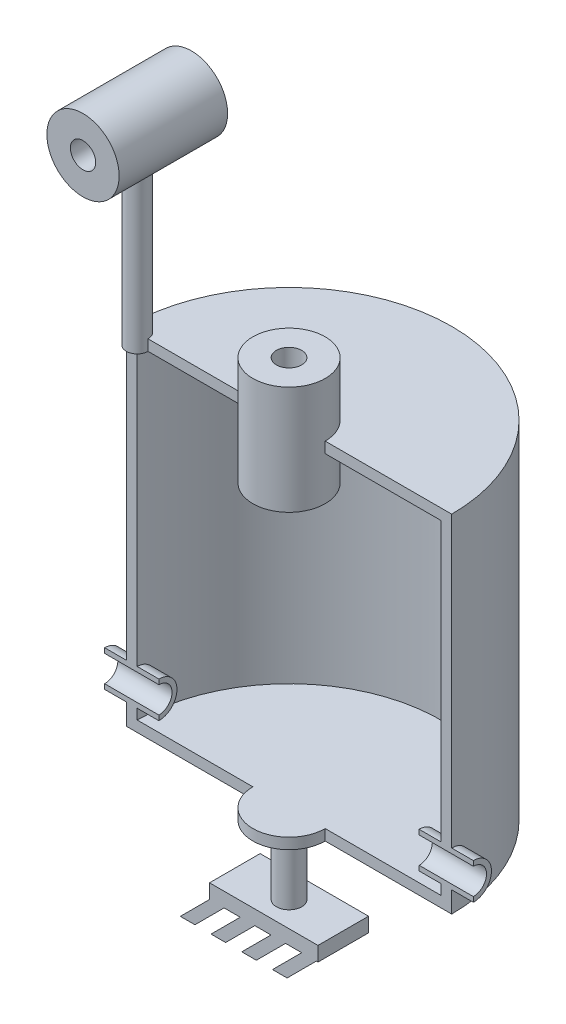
ISO-10303-21;
HEADER;
FILE_DESCRIPTION(('STEP AP214'),'2;1');
FILE_NAME('part.step','',(''),(''),'','','');
FILE_SCHEMA(('AUTOMOTIVE_DESIGN { 1 0 10303 214 1 1 1 1 }'));
ENDSEC;
DATA;
#1=APPLICATION_CONTEXT('core data for automotive mechanical design processes');
#2=APPLICATION_PROTOCOL_DEFINITION('international standard','automotive_design',2000,#1);
#3=PRODUCT_CONTEXT('',#1,'mechanical');
#4=PRODUCT('Part','Part','',(#3));
#5=PRODUCT_RELATED_PRODUCT_CATEGORY('part','',(#4));
#6=PRODUCT_DEFINITION_FORMATION('','',#4);
#7=PRODUCT_DEFINITION_CONTEXT('part definition',#1,'design');
#8=PRODUCT_DEFINITION('design','',#6,#7);
#9=PRODUCT_DEFINITION_SHAPE('','',#8);
#10=(LENGTH_UNIT() NAMED_UNIT(*) SI_UNIT(.MILLI.,.METRE.));
#11=(NAMED_UNIT(*) PLANE_ANGLE_UNIT() SI_UNIT($,.RADIAN.));
#12=(NAMED_UNIT(*) SI_UNIT($,.STERADIAN.) SOLID_ANGLE_UNIT());
#13=UNCERTAINTY_MEASURE_WITH_UNIT(LENGTH_MEASURE(1.E-05),#10,'distance_accuracy_value','');
#14=(GEOMETRIC_REPRESENTATION_CONTEXT(3) GLOBAL_UNCERTAINTY_ASSIGNED_CONTEXT((#13)) GLOBAL_UNIT_ASSIGNED_CONTEXT((#10,
#11,#12)) REPRESENTATION_CONTEXT('',''));
#15=CARTESIAN_POINT('',(0.,0.,0.));
#16=DIRECTION('',(0.,0.,1.));
#17=DIRECTION('',(1.,0.,0.));
#18=AXIS2_PLACEMENT_3D('',#15,#16,#17);
#19=CARTESIAN_POINT('',(-15.0000000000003,-118.823254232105,-7.));
#20=DIRECTION('',(0.,-1.,0.));
#21=DIRECTION('',(1.,0.,0.));
#22=AXIS2_PLACEMENT_3D('',#19,#20,#21);
#23=PLANE('',#22);
#24=DIRECTION('',(0.,0.,1.));
#25=VECTOR('',#24,1.);
#26=CARTESIAN_POINT('',(10.4999999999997,-118.823254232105,-21.5628026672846));
#27=LINE('',#26,#25);
#28=CARTESIAN_POINT('',(10.4999999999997,-118.823254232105,-7.));
#29=VERTEX_POINT('',#28);
#30=CARTESIAN_POINT('',(10.4999999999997,-118.823254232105,7.));
#31=VERTEX_POINT('',#30);
#32=EDGE_CURVE('E62',#29,#31,#27,.T.);
#33=ORIENTED_EDGE('',*,*,#32,.T.);
#34=DIRECTION('',(-1.,0.,0.));
#35=VECTOR('',#34,1.);
#36=CARTESIAN_POINT('',(-15.0000000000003,-118.823254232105,7.));
#37=LINE('',#36,#35);
#38=CARTESIAN_POINT('',(6.03899474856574,-118.823254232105,7.));
#39=VERTEX_POINT('',#38);
#40=EDGE_CURVE('E48',#31,#39,#37,.T.);
#41=ORIENTED_EDGE('',*,*,#40,.T.);
#42=DIRECTION('',(0.,0.,1.));
#43=VECTOR('',#42,1.);
#44=CARTESIAN_POINT('',(6.03899474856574,-118.823254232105,-21.5628026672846));
#45=LINE('',#44,#43);
#46=CARTESIAN_POINT('',(6.03899474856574,-118.823254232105,-7.));
#47=VERTEX_POINT('',#46);
#48=EDGE_CURVE('E360',#47,#39,#45,.T.);
#49=ORIENTED_EDGE('',*,*,#48,.F.);
#50=DIRECTION('',(1.,0.,0.));
#51=VECTOR('',#50,1.);
#52=CARTESIAN_POINT('',(-15.0000000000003,-118.823254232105,-7.));
#53=LINE('',#52,#51);
#54=EDGE_CURVE('E425',#47,#29,#53,.T.);
#55=ORIENTED_EDGE('',*,*,#54,.T.);
#56=EDGE_LOOP('',(#33,#41,#49,#55));
#57=FACE_BOUND('',#56,.T.);
#58=ADVANCED_FACE('F44',(#57),#23,.T.);
#59=DIRECTION('',(0.,0.,1.));
#60=VECTOR('',#59,1.);
#61=CARTESIAN_POINT('',(1.99999999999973,-118.823254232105,-21.5628026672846));
#62=LINE('',#61,#60);
#63=CARTESIAN_POINT('',(1.99999999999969,-118.823254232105,-7.));
#64=VERTEX_POINT('',#63);
#65=CARTESIAN_POINT('',(1.9999999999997,-118.823254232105,7.));
#66=VERTEX_POINT('',#65);
#67=EDGE_CURVE('E347',#64,#66,#62,.T.);
#68=ORIENTED_EDGE('',*,*,#67,.T.);
#69=CARTESIAN_POINT('',(-2.46100525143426,-118.823254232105,7.));
#70=VERTEX_POINT('',#69);
#71=EDGE_CURVE('E439',#66,#70,#37,.T.);
#72=ORIENTED_EDGE('',*,*,#71,.T.);
#73=DIRECTION('',(0.,0.,1.));
#74=VECTOR('',#73,1.);
#75=CARTESIAN_POINT('',(-2.46100525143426,-118.823254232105,-21.5628026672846));
#76=LINE('',#75,#74);
#77=CARTESIAN_POINT('',(-2.46100525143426,-118.823254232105,-7.));
#78=VERTEX_POINT('',#77);
#79=EDGE_CURVE('E385',#78,#70,#76,.T.);
#80=ORIENTED_EDGE('',*,*,#79,.F.);
#81=EDGE_CURVE('E423',#78,#64,#53,.T.);
#82=ORIENTED_EDGE('',*,*,#81,.T.);
#83=EDGE_LOOP('',(#68,#72,#80,#82));
#84=FACE_BOUND('',#83,.T.);
#85=ADVANCED_FACE('F550',(#84),#23,.T.);
#86=DIRECTION('',(0.,0.,1.));
#87=VECTOR('',#86,1.);
#88=CARTESIAN_POINT('',(-6.50000000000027,-118.823254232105,-21.5628026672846));
#89=LINE('',#88,#87);
#90=CARTESIAN_POINT('',(-6.50000000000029,-118.823254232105,-7.));
#91=VERTEX_POINT('',#90);
#92=CARTESIAN_POINT('',(-6.50000000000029,-118.823254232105,7.));
#93=VERTEX_POINT('',#92);
#94=EDGE_CURVE('E371',#91,#93,#89,.T.);
#95=ORIENTED_EDGE('',*,*,#94,.T.);
#96=CARTESIAN_POINT('',(-10.9610052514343,-118.823254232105,7.));
#97=VERTEX_POINT('',#96);
#98=EDGE_CURVE('E426',#93,#97,#37,.T.);
#99=ORIENTED_EDGE('',*,*,#98,.T.);
#100=DIRECTION('',(0.,0.,1.));
#101=VECTOR('',#100,1.);
#102=CARTESIAN_POINT('',(-10.9610052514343,-118.823254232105,-21.5628026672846));
#103=LINE('',#102,#101);
#104=CARTESIAN_POINT('',(-10.9610052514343,-118.823254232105,-7.));
#105=VERTEX_POINT('',#104);
#106=EDGE_CURVE('E396',#105,#97,#103,.T.);
#107=ORIENTED_EDGE('',*,*,#106,.F.);
#108=EDGE_CURVE('E411',#105,#91,#53,.T.);
#109=ORIENTED_EDGE('',*,*,#108,.T.);
#110=EDGE_LOOP('',(#95,#99,#107,#109));
#111=FACE_BOUND('',#110,.T.);
#112=ADVANCED_FACE('F500',(#111),#23,.T.);
#113=CARTESIAN_POINT('',(45.,-95.8232542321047,0.));
#114=DIRECTION('',(0.,1.,0.));
#115=DIRECTION('',(0.,0.,1.));
#116=AXIS2_PLACEMENT_3D('',#113,#114,#115);
#117=PLANE('',#116);
#118=CARTESIAN_POINT('',(-2.21635798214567E-13,-95.8232542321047,0.));
#119=DIRECTION('',(0.,1.,0.));
#120=DIRECTION('',(0.,0.,1.));
#121=AXIS2_PLACEMENT_3D('',#118,#119,#120);
#122=CIRCLE('',#121,10.);
#123=CARTESIAN_POINT('',(9.9999999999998,-95.8232542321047,0.));
#124=VERTEX_POINT('',#123);
#125=CARTESIAN_POINT('',(-10.0000000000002,-95.8232542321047,0.));
#126=VERTEX_POINT('',#125);
#127=EDGE_CURVE('E710',#124,#126,#122,.F.);
#128=ORIENTED_EDGE('',*,*,#127,.T.);
#129=DIRECTION('',(-1.,0.,0.));
#130=VECTOR('',#129,1.);
#131=CARTESIAN_POINT('',(45.,-95.8232542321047,0.));
#132=LINE('',#131,#130);
#133=CARTESIAN_POINT('',(-45.,-95.8232542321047,0.));
#134=VERTEX_POINT('',#133);
#135=EDGE_CURVE('E686',#126,#134,#132,.T.);
#136=ORIENTED_EDGE('',*,*,#135,.T.);
#137=CARTESIAN_POINT('',(0.,-95.8232542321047,0.));
#138=DIRECTION('',(0.,1.,0.));
#139=DIRECTION('',(0.,0.,1.));
#140=AXIS2_PLACEMENT_3D('',#137,#138,#139);
#141=CIRCLE('',#140,45.);
#142=CARTESIAN_POINT('',(45.,-95.8232542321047,0.));
#143=VERTEX_POINT('',#142);
#144=EDGE_CURVE('E805',#143,#134,#141,.T.);
#145=ORIENTED_EDGE('',*,*,#144,.F.);
#146=DIRECTION('',(-1.,0.,0.));
#147=VECTOR('',#146,1.);
#148=CARTESIAN_POINT('',(45.,-95.8232542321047,0.));
#149=LINE('',#148,#147);
#150=EDGE_CURVE('E655',#143,#124,#149,.T.);
#151=ORIENTED_EDGE('',*,*,#150,.T.);
#152=EDGE_LOOP('',(#128,#136,#145,#151));
#153=FACE_BOUND('',#152,.T.);
#154=CARTESIAN_POINT('',(-2.21635798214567E-13,-95.8232542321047,0.));
#155=DIRECTION('',(0.,1.,0.));
#156=DIRECTION('',(0.,0.,1.));
#157=AXIS2_PLACEMENT_3D('',#154,#155,#156);
#158=CIRCLE('',#157,3.50000000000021);
#159=CARTESIAN_POINT('',(-2.21635798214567E-13,-95.8232542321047,3.50000000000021));
#160=VERTEX_POINT('',#159);
#161=EDGE_CURVE('E13',#160,#160,#158,.F.);
#162=ORIENTED_EDGE('',*,*,#161,.F.);
#163=EDGE_LOOP('',(#162));
#164=FACE_BOUND('',#163,.T.);
#165=ADVANCED_FACE('F558',(#153,#164),#117,.F.);
#166=CARTESIAN_POINT('',(-41.9999999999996,50.0000000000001,0.));
#167=DIRECTION('',(0.,-1.,0.));
#168=DIRECTION('',(1.,0.,0.));
#169=AXIS2_PLACEMENT_3D('',#166,#167,#168);
#170=CYLINDRICAL_SURFACE('',#169,2.99999999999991);
#171=CARTESIAN_POINT('',(-41.9999999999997,-2.9999999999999,0.));
#172=DIRECTION('',(0.,1.,0.));
#173=DIRECTION('',(-1.,0.,0.));
#174=AXIS2_PLACEMENT_3D('',#171,#172,#173);
#175=CIRCLE('',#174,2.99999999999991);
#176=CARTESIAN_POINT('',(-44.9999999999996,-2.9999999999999,0.));
#177=VERTEX_POINT('',#176);
#178=CARTESIAN_POINT('',(-38.9999999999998,-2.99999999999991,0.));
#179=VERTEX_POINT('',#178);
#180=EDGE_CURVE('E628',#177,#179,#175,.T.);
#181=ORIENTED_EDGE('',*,*,#180,.T.);
#182=DIRECTION('',(0.,-1.,0.));
#183=VECTOR('',#182,1.);
#184=CARTESIAN_POINT('',(-38.9999999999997,50.0000000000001,0.));
#185=LINE('',#184,#183);
#186=CARTESIAN_POINT('',(-38.9999999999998,0.,0.));
#187=VERTEX_POINT('',#186);
#188=EDGE_CURVE('E454',#179,#187,#185,.F.);
#189=ORIENTED_EDGE('',*,*,#188,.T.);
#190=CARTESIAN_POINT('',(-41.9999999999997,0.,0.));
#191=DIRECTION('',(0.,-1.,0.));
#192=DIRECTION('',(0.,0.,-1.));
#193=AXIS2_PLACEMENT_3D('',#190,#191,#192);
#194=CIRCLE('',#193,2.99999999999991);
#195=CARTESIAN_POINT('',(-44.9999999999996,1.04083408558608E-13,0.));
#196=VERTEX_POINT('',#195);
#197=EDGE_CURVE('E630',#187,#196,#194,.F.);
#198=ORIENTED_EDGE('',*,*,#197,.T.);
#199=DIRECTION('',(0.,1.,0.));
#200=VECTOR('',#199,1.);
#201=CARTESIAN_POINT('',(-45.,-92.8232542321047,0.));
#202=LINE('',#201,#200);
#203=EDGE_CURVE('E687',#177,#196,#202,.T.);
#204=ORIENTED_EDGE('',*,*,#203,.F.);
#205=EDGE_LOOP('',(#181,#189,#198,#204));
#206=FACE_BOUND('',#205,.T.);
#207=CARTESIAN_POINT('',(-38.9999999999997,40.4606079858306,0.));
#208=CARTESIAN_POINT('',(-39.0000020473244,40.4606062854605,-0.164389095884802));
#209=CARTESIAN_POINT('',(-39.0135578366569,40.4563121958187,-0.32879844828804));
#210=CARTESIAN_POINT('',(-39.0672831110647,40.4396684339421,-0.652810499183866));
#211=CARTESIAN_POINT('',(-39.1074614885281,40.4273160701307,-0.812411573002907));
#212=CARTESIAN_POINT('',(-39.2129449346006,40.3960779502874,-1.12206945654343));
#213=CARTESIAN_POINT('',(-39.2782082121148,40.3772030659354,-1.27214165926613));
#214=CARTESIAN_POINT('',(-39.4318715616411,40.3350613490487,-1.55924386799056));
#215=CARTESIAN_POINT('',(-39.5202750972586,40.3117938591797,-1.69627191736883));
#216=CARTESIAN_POINT('',(-39.7207049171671,40.2626627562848,-1.95773278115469));
#217=CARTESIAN_POINT('',(-39.8333358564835,40.2367438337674,-2.08169179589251));
#218=CARTESIAN_POINT('',(-40.0777275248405,40.1857027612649,-2.30927590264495));
#219=CARTESIAN_POINT('',(-40.2094907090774,40.160580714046,-2.41289838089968));
#220=CARTESIAN_POINT('',(-40.4917771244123,40.1133357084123,-2.59892539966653));
#221=CARTESIAN_POINT('',(-40.642631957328,40.091285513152,-2.68084684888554));
#222=CARTESIAN_POINT('',(-40.9567507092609,40.0533112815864,-2.81797451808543));
#223=CARTESIAN_POINT('',(-41.1200119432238,40.0373859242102,-2.87318649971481));
#224=CARTESIAN_POINT('',(-41.449352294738,40.0138470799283,-2.95376000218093));
#225=CARTESIAN_POINT('',(-41.615217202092,40.0060088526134,-2.97993025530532));
#226=CARTESIAN_POINT('',(-41.949156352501,39.9987359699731,-3.00423464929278));
#227=CARTESIAN_POINT('',(-42.1172301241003,39.9992995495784,-3.00237467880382));
#228=CARTESIAN_POINT('',(-42.4451423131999,40.008607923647,-2.97121426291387));
#229=CARTESIAN_POINT('',(-42.6050725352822,40.0170915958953,-2.94278961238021));
#230=CARTESIAN_POINT('',(-42.9177784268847,40.0409695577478,-2.86073732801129));
#231=CARTESIAN_POINT('',(-43.0705536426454,40.0563642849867,-2.80710809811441));
#232=CARTESIAN_POINT('',(-43.366694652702,40.0926955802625,-2.67557595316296));
#233=CARTESIAN_POINT('',(-43.5099301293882,40.1136946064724,-2.59739759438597));
#234=CARTESIAN_POINT('',(-43.7815293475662,40.1590071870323,-2.41920429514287));
#235=CARTESIAN_POINT('',(-43.909889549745,40.1833215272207,-2.31918417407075));
#236=CARTESIAN_POINT('',(-44.1533209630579,40.2337689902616,-2.09560449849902));
#237=CARTESIAN_POINT('',(-44.2676891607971,40.2599360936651,-1.97128616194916));
#238=CARTESIAN_POINT('',(-44.4741530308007,40.3103204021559,-1.70497996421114));
#239=CARTESIAN_POINT('',(-44.566246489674,40.3345374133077,-1.56299034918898));
#240=CARTESIAN_POINT('',(-44.7262799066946,40.378441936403,-1.26352106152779));
#241=CARTESIAN_POINT('',(-44.7939797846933,40.3980837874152,-1.10590590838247));
#242=CARTESIAN_POINT('',(-44.9016672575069,40.4300721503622,-0.780785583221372));
#243=CARTESIAN_POINT('',(-44.9416638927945,40.4424210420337,-0.613283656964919));
#244=CARTESIAN_POINT('',(-44.9914954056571,40.4579030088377,-0.279835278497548));
#245=CARTESIAN_POINT('',(-45.0023989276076,40.4613624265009,-0.114063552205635));
#246=CARTESIAN_POINT('',(-44.9967189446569,40.4595761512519,0.216945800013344));
#247=CARTESIAN_POINT('',(-44.9801392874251,40.4543316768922,0.382183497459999));
#248=CARTESIAN_POINT('',(-44.9209152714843,40.4360488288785,0.702976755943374));
#249=CARTESIAN_POINT('',(-44.8789592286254,40.4232164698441,0.858672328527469));
#250=CARTESIAN_POINT('',(-44.770971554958,40.3914171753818,1.16080338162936));
#251=CARTESIAN_POINT('',(-44.7049362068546,40.3724492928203,1.30723742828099));
#252=CARTESIAN_POINT('',(-44.5486374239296,40.3298832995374,1.59103492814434));
#253=CARTESIAN_POINT('',(-44.4577712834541,40.3061745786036,1.72804944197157));
#254=CARTESIAN_POINT('',(-44.2551060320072,40.2570358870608,1.98527621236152));
#255=CARTESIAN_POINT('',(-44.1433019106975,40.2316055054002,2.10548443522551));
#256=CARTESIAN_POINT('',(-43.8969102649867,40.1807273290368,2.33036081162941));
#257=CARTESIAN_POINT('',(-43.7616221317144,40.15531509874,2.43427125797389));
#258=CARTESIAN_POINT('',(-43.47492356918,40.1083029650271,2.61793340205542));
#259=CARTESIAN_POINT('',(-43.3235139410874,40.0867028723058,2.69768629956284));
#260=CARTESIAN_POINT('',(-43.00987100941,40.0498805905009,2.83000006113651));
#261=CARTESIAN_POINT('',(-42.8477292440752,40.0346109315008,2.88276403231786));
#262=CARTESIAN_POINT('',(-42.5163399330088,40.0119604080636,2.96012183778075));
#263=CARTESIAN_POINT('',(-42.3470944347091,40.0045772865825,2.98472373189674));
#264=CARTESIAN_POINT('',(-42.0133043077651,39.9986691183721,3.00444608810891));
#265=CARTESIAN_POINT('',(-41.8488296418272,39.9998138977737,3.00066539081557));
#266=CARTESIAN_POINT('',(-41.5229610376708,40.0100547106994,2.96635673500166));
#267=CARTESIAN_POINT('',(-41.3615669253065,40.0191502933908,2.93583029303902));
#268=CARTESIAN_POINT('',(-41.0481283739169,40.0441766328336,2.84957667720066));
#269=CARTESIAN_POINT('',(-40.8960021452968,40.0600329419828,2.79412363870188));
#270=CARTESIAN_POINT('',(-40.6031335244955,40.0969411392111,2.65983617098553));
#271=CARTESIAN_POINT('',(-40.4623930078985,40.1179938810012,2.58099789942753));
#272=CARTESIAN_POINT('',(-40.1913962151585,40.1639206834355,2.39925308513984));
#273=CARTESIAN_POINT('',(-40.0616194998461,40.1888954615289,2.29565713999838));
#274=CARTESIAN_POINT('',(-39.8209248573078,40.2395292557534,2.06857922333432));
#275=CARTESIAN_POINT('',(-39.7100123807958,40.2651884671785,1.94509152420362));
#276=CARTESIAN_POINT('',(-39.5068746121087,40.3151863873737,1.67731844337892));
#277=CARTESIAN_POINT('',(-39.4153048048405,40.3394629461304,1.53252289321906));
#278=CARTESIAN_POINT('',(-39.2579137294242,40.3829490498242,1.22888965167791));
#279=CARTESIAN_POINT('',(-39.1920800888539,40.402161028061,1.07005875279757));
#280=CARTESIAN_POINT('',(-39.0939611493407,40.4314436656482,0.760519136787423));
#281=CARTESIAN_POINT('',(-39.0588228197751,40.4422769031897,0.610782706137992));
#282=CARTESIAN_POINT('',(-39.0118436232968,40.4568591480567,0.307369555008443));
#283=CARTESIAN_POINT('',(-38.9999980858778,40.4606095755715,0.153693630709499));
#284=CARTESIAN_POINT('',(-38.9999999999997,40.4606079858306,0.));
#285=B_SPLINE_CURVE_WITH_KNOTS('',3,(#207,#208,#209,#210,#211,#212,#213,#214,#215,#216,#217,
#218,#219,#220,#221,#222,#223,#224,#225,#226,#227,#228,#229,#230,#231,#232,#233,#234,#235,#236,
#237,#238,#239,#240,#241,#242,#243,#244,#245,#246,#247,#248,#249,#250,#251,#252,#253,#254,#255,
#256,#257,#258,#259,#260,#261,#262,#263,#264,#265,#266,#267,#268,#269,#270,#271,#272,#273,#274,
#275,#276,#277,#278,#279,#280,#281,#282,#283,#284),.UNSPECIFIED.,.T.,.F.,(4,2,2,2,2,2,2,2,2,2,2,
2,2,2,2,2,2,2,2,2,2,2,2,2,2,2,2,2,2,2,2,2,2,2,2,2,2,2,4),(0.,0.49260033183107,0.98536528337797,
1.47731282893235,1.96933405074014,2.4754630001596,2.98165695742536,3.49831878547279,
4.01486911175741,4.51664280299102,5.01831108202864,5.50400251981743,5.98972471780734,
6.48110418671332,6.9726003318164,7.48304294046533,7.99353624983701,8.50892476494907,
9.02414501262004,9.52016161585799,10.0161087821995,10.4991718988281,10.9823096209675,
11.4784146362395,11.9746385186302,12.4895901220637,13.0045161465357,13.5155078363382,
14.0263532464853,14.5175260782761,15.0086710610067,15.494541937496,15.9804926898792,
16.4819925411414,16.9836370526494,17.5002327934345,18.0165798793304,18.4772230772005,
18.9377739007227),.UNSPECIFIED.);
#286=CARTESIAN_POINT('',(-38.9999999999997,40.4606079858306,0.));
#287=VERTEX_POINT('',#286);
#288=EDGE_CURVE('E54',#287,#287,#285,.T.);
#289=ORIENTED_EDGE('',*,*,#288,.F.);
#290=EDGE_LOOP('',(#289));
#291=FACE_BOUND('',#290,.T.);
#292=ADVANCED_FACE('F456',(#206,#291),#170,.T.);
#293=CARTESIAN_POINT('',(10.,0.,0.));
#294=DIRECTION('',(0.,-1.,0.));
#295=DIRECTION('',(0.,0.,-1.));
#296=AXIS2_PLACEMENT_3D('',#293,#294,#295);
#297=PLANE('',#296);
#298=ORIENTED_EDGE('',*,*,#197,.F.);
#299=DIRECTION('',(-1.,0.,0.));
#300=VECTOR('',#299,1.);
#301=CARTESIAN_POINT('',(-58.4070796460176,1.35093509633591E-13,0.));
#302=LINE('',#301,#300);
#303=CARTESIAN_POINT('',(-10.,0.,0.));
#304=VERTEX_POINT('',#303);
#305=EDGE_CURVE('E635',#304,#187,#302,.T.);
#306=ORIENTED_EDGE('',*,*,#305,.F.);
#307=CARTESIAN_POINT('',(0.,0.,0.));
#308=DIRECTION('',(0.,-1.,0.));
#309=DIRECTION('',(0.,0.,-1.));
#310=AXIS2_PLACEMENT_3D('',#307,#308,#309);
#311=CIRCLE('',#310,10.);
#312=CARTESIAN_POINT('',(10.,0.,0.));
#313=VERTEX_POINT('',#312);
#314=EDGE_CURVE('E825',#304,#313,#311,.T.);
#315=ORIENTED_EDGE('',*,*,#314,.T.);
#316=DIRECTION('',(-1.,0.,0.));
#317=VECTOR('',#316,1.);
#318=CARTESIAN_POINT('',(10.,0.,0.));
#319=LINE('',#318,#317);
#320=CARTESIAN_POINT('',(45.,-1.04083408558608E-13,0.));
#321=VERTEX_POINT('',#320);
#322=EDGE_CURVE('E632',#321,#313,#319,.T.);
#323=ORIENTED_EDGE('',*,*,#322,.F.);
#324=CARTESIAN_POINT('',(0.,0.,0.));
#325=DIRECTION('',(0.,1.,0.));
#326=DIRECTION('',(0.,0.,1.));
#327=AXIS2_PLACEMENT_3D('',#324,#325,#326);
#328=CIRCLE('',#327,45.);
#329=EDGE_CURVE('E810',#321,#196,#328,.T.);
#330=ORIENTED_EDGE('',*,*,#329,.T.);
#331=EDGE_LOOP('',(#298,#306,#315,#323,#330));
#332=FACE_BOUND('',#331,.T.);
#333=ADVANCED_FACE('F785',(#332),#297,.F.);
#334=CARTESIAN_POINT('',(-58.4070796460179,-110.,0.));
#335=DIRECTION('',(0.,0.,-1.));
#336=DIRECTION('',(-1.,0.,0.));
#337=AXIS2_PLACEMENT_3D('',#334,#335,#336);
#338=PLANE('',#337);
#339=ORIENTED_EDGE('',*,*,#188,.F.);
#340=DIRECTION('',(-1.,0.,0.));
#341=VECTOR('',#340,1.);
#342=CARTESIAN_POINT('',(10.,-3.,0.));
#343=LINE('',#342,#341);
#344=CARTESIAN_POINT('',(-10.,-3.,0.));
#345=VERTEX_POINT('',#344);
#346=EDGE_CURVE('E704',#345,#179,#343,.T.);
#347=ORIENTED_EDGE('',*,*,#346,.F.);
#348=DIRECTION('',(0.,1.,0.));
#349=VECTOR('',#348,1.);
#350=CARTESIAN_POINT('',(-10.0000000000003,-110.,0.));
#351=LINE('',#350,#349);
#352=EDGE_CURVE('E639',#345,#304,#351,.T.);
#353=ORIENTED_EDGE('',*,*,#352,.T.);
#354=ORIENTED_EDGE('',*,*,#305,.T.);
#355=EDGE_LOOP('',(#339,#347,#353,#354));
#356=FACE_BOUND('',#355,.T.);
#357=ADVANCED_FACE('F861',(#356),#338,.F.);
#358=DIRECTION('',(1.,0.,0.));
#359=VECTOR('',#358,1.);
#360=CARTESIAN_POINT('',(-58.4070796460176,-2.99999999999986,0.));
#361=LINE('',#360,#359);
#362=CARTESIAN_POINT('',(-42.,-3.,0.));
#363=VERTEX_POINT('',#362);
#364=EDGE_CURVE('E844',#177,#363,#361,.T.);
#365=ORIENTED_EDGE('',*,*,#364,.F.);
#366=CARTESIAN_POINT('',(-45.,-80.,0.));
#367=VERTEX_POINT('',#366);
#368=EDGE_CURVE('E688',#367,#177,#202,.T.);
#369=ORIENTED_EDGE('',*,*,#368,.F.);
#370=DIRECTION('',(1.,0.,0.));
#371=VECTOR('',#370,1.);
#372=CARTESIAN_POINT('',(-28.5036728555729,-80.,0.));
#373=LINE('',#372,#371);
#374=CARTESIAN_POINT('',(-51.,-80.,0.));
#375=VERTEX_POINT('',#374);
#376=EDGE_CURVE('E700',#367,#375,#373,.F.);
#377=ORIENTED_EDGE('',*,*,#376,.T.);
#378=DIRECTION('',(0.,-1.,0.));
#379=VECTOR('',#378,1.);
#380=CARTESIAN_POINT('',(-51.,-85.,0.));
#381=LINE('',#380,#379);
#382=CARTESIAN_POINT('',(-51.,-81.367752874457,0.));
#383=VERTEX_POINT('',#382);
#384=EDGE_CURVE('E678',#375,#383,#381,.T.);
#385=ORIENTED_EDGE('',*,*,#384,.T.);
#386=DIRECTION('',(1.,0.,0.));
#387=VECTOR('',#386,1.);
#388=CARTESIAN_POINT('',(-59.,-81.367752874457,0.));
#389=LINE('',#388,#387);
#390=CARTESIAN_POINT('',(-36.,-81.367752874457,0.));
#391=VERTEX_POINT('',#390);
#392=EDGE_CURVE('E842',#391,#383,#389,.F.);
#393=ORIENTED_EDGE('',*,*,#392,.F.);
#394=DIRECTION('',(0.,1.,0.));
#395=VECTOR('',#394,1.);
#396=CARTESIAN_POINT('',(-36.,-85.,0.));
#397=LINE('',#396,#395);
#398=CARTESIAN_POINT('',(-36.,-80.,0.));
#399=VERTEX_POINT('',#398);
#400=EDGE_CURVE('E683',#391,#399,#397,.T.);
#401=ORIENTED_EDGE('',*,*,#400,.T.);
#402=DIRECTION('',(1.,0.,0.));
#403=VECTOR('',#402,1.);
#404=CARTESIAN_POINT('',(-28.5036728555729,-80.,0.));
#405=LINE('',#404,#403);
#406=CARTESIAN_POINT('',(-42.,-80.,0.));
#407=VERTEX_POINT('',#406);
#408=EDGE_CURVE('E702',#399,#407,#405,.F.);
#409=ORIENTED_EDGE('',*,*,#408,.T.);
#410=DIRECTION('',(0.,1.,0.));
#411=VECTOR('',#410,1.);
#412=CARTESIAN_POINT('',(-42.,-92.8232542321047,0.));
#413=LINE('',#412,#411);
#414=EDGE_CURVE('E697',#363,#407,#413,.F.);
#415=ORIENTED_EDGE('',*,*,#414,.F.);
#416=EDGE_LOOP('',(#365,#369,#377,#385,#393,#401,#409,#415));
#417=FACE_BOUND('',#416,.T.);
#418=ADVANCED_FACE('F891',(#417),#338,.F.);
#419=CARTESIAN_POINT('',(0.,15.,0.));
#420=DIRECTION('',(0.,-1.,0.));
#421=DIRECTION('',(0.,0.,-1.));
#422=AXIS2_PLACEMENT_3D('',#419,#420,#421);
#423=CYLINDRICAL_SURFACE('',#422,10.);
#424=ORIENTED_EDGE('',*,*,#352,.F.);
#425=CARTESIAN_POINT('',(0.,-3.,0.));
#426=DIRECTION('',(0.,1.,0.));
#427=DIRECTION('',(0.,0.,1.));
#428=AXIS2_PLACEMENT_3D('',#425,#426,#427);
#429=CIRCLE('',#428,10.);
#430=CARTESIAN_POINT('',(10.,-3.,0.));
#431=VERTEX_POINT('',#430);
#432=EDGE_CURVE('E827',#431,#345,#429,.T.);
#433=ORIENTED_EDGE('',*,*,#432,.F.);
#434=DIRECTION('',(0.,1.,0.));
#435=VECTOR('',#434,1.);
#436=CARTESIAN_POINT('',(9.99999999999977,-110.,0.));
#437=LINE('',#436,#435);
#438=EDGE_CURVE('E638',#431,#313,#437,.T.);
#439=ORIENTED_EDGE('',*,*,#438,.T.);
#440=ORIENTED_EDGE('',*,*,#314,.F.);
#441=EDGE_LOOP('',(#424,#433,#439,#440));
#442=FACE_BOUND('',#441,.T.);
#443=CARTESIAN_POINT('',(0.,15.,0.));
#444=DIRECTION('',(0.,1.,0.));
#445=DIRECTION('',(0.,0.,1.));
#446=AXIS2_PLACEMENT_3D('',#443,#444,#445);
#447=CIRCLE('',#446,10.);
#448=CARTESIAN_POINT('',(0.,15.,10.));
#449=VERTEX_POINT('',#448);
#450=EDGE_CURVE('E822',#449,#449,#447,.T.);
#451=ORIENTED_EDGE('',*,*,#450,.F.);
#452=EDGE_LOOP('',(#451));
#453=FACE_BOUND('',#452,.T.);
#454=CARTESIAN_POINT('',(0.,-15.,0.));
#455=DIRECTION('',(0.,1.,0.));
#456=DIRECTION('',(0.,0.,1.));
#457=AXIS2_PLACEMENT_3D('',#454,#455,#456);
#458=CIRCLE('',#457,10.);
#459=CARTESIAN_POINT('',(0.,-15.,10.));
#460=VERTEX_POINT('',#459);
#461=EDGE_CURVE('E816',#460,#460,#458,.T.);
#462=ORIENTED_EDGE('',*,*,#461,.T.);
#463=EDGE_LOOP('',(#462));
#464=FACE_BOUND('',#463,.T.);
#465=ADVANCED_FACE('F46',(#442,#453,#464),#423,.T.);
#466=CARTESIAN_POINT('',(0.,15.,0.));
#467=DIRECTION('',(0.,1.,0.));
#468=DIRECTION('',(0.,0.,1.));
#469=AXIS2_PLACEMENT_3D('',#466,#467,#468);
#470=PLANE('',#469);
#471=ORIENTED_EDGE('',*,*,#450,.T.);
#472=EDGE_LOOP('',(#471));
#473=FACE_BOUND('',#472,.T.);
#474=CARTESIAN_POINT('',(0.,15.,0.));
#475=DIRECTION('',(0.,1.,0.));
#476=DIRECTION('',(0.,0.,1.));
#477=AXIS2_PLACEMENT_3D('',#474,#475,#476);
#478=CIRCLE('',#477,3.5);
#479=CARTESIAN_POINT('',(0.,15.,3.5));
#480=VERTEX_POINT('',#479);
#481=EDGE_CURVE('E819',#480,#480,#478,.T.);
#482=ORIENTED_EDGE('',*,*,#481,.F.);
#483=EDGE_LOOP('',(#482));
#484=FACE_BOUND('',#483,.T.);
#485=ADVANCED_FACE('F1249',(#473,#484),#470,.T.);
#486=CARTESIAN_POINT('',(0.,15.,0.));
#487=DIRECTION('',(0.,-1.,0.));
#488=DIRECTION('',(0.,0.,-1.));
#489=AXIS2_PLACEMENT_3D('',#486,#487,#488);
#490=CYLINDRICAL_SURFACE('',#489,3.5);
#491=ORIENTED_EDGE('',*,*,#481,.T.);
#492=EDGE_LOOP('',(#491));
#493=FACE_BOUND('',#492,.T.);
#494=CARTESIAN_POINT('',(0.,-15.,0.));
#495=DIRECTION('',(0.,1.,0.));
#496=DIRECTION('',(0.,0.,1.));
#497=AXIS2_PLACEMENT_3D('',#494,#495,#496);
#498=CIRCLE('',#497,3.5);
#499=CARTESIAN_POINT('',(0.,-15.,3.5));
#500=VERTEX_POINT('',#499);
#501=EDGE_CURVE('E808',#500,#500,#498,.T.);
#502=ORIENTED_EDGE('',*,*,#501,.F.);
#503=EDGE_LOOP('',(#502));
#504=FACE_BOUND('',#503,.T.);
#505=ADVANCED_FACE('F1257',(#493,#504),#490,.F.);
#506=CARTESIAN_POINT('',(0.,-15.,0.));
#507=DIRECTION('',(0.,1.,0.));
#508=DIRECTION('',(0.,0.,1.));
#509=AXIS2_PLACEMENT_3D('',#506,#507,#508);
#510=PLANE('',#509);
#511=ORIENTED_EDGE('',*,*,#501,.T.);
#512=EDGE_LOOP('',(#511));
#513=FACE_BOUND('',#512,.T.);
#514=ORIENTED_EDGE('',*,*,#461,.F.);
#515=EDGE_LOOP('',(#514));
#516=FACE_BOUND('',#515,.T.);
#517=ADVANCED_FACE('F1020',(#513,#516),#510,.F.);
#518=CARTESIAN_POINT('',(0.,-92.8232542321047,0.));
#519=DIRECTION('',(0.,1.,0.));
#520=DIRECTION('',(0.,0.,1.));
#521=AXIS2_PLACEMENT_3D('',#518,#519,#520);
#522=CYLINDRICAL_SURFACE('',#521,45.);
#523=ORIENTED_EDGE('',*,*,#144,.T.);
#524=CARTESIAN_POINT('',(-45.,-90.,0.));
#525=VERTEX_POINT('',#524);
#526=EDGE_CURVE('E682',#134,#525,#202,.T.);
#527=ORIENTED_EDGE('',*,*,#526,.T.);
#528=CARTESIAN_POINT('',(-44.7213595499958,-85.,5.));
#529=CARTESIAN_POINT('',(-44.7213590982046,-85.1400096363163,5.00000147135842));
#530=CARTESIAN_POINT('',(-44.7220183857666,-85.2799971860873,4.99411701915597));
#531=CARTESIAN_POINT('',(-44.7246358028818,-85.5590174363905,4.97062354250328));
#532=CARTESIAN_POINT('',(-44.7265942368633,-85.6980499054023,4.95301176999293));
#533=CARTESIAN_POINT('',(-44.7317564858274,-85.9742281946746,4.90617105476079));
#534=CARTESIAN_POINT('',(-44.7349612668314,-86.1113724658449,4.87693310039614));
#535=CARTESIAN_POINT('',(-44.7425253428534,-86.3827426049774,4.8070428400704));
#536=CARTESIAN_POINT('',(-44.74688506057,-86.5169673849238,4.76638635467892));
#537=CARTESIAN_POINT('',(-44.756628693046,-86.7813616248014,4.67400695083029));
#538=CARTESIAN_POINT('',(-44.762011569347,-86.9115350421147,4.62229524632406));
#539=CARTESIAN_POINT('',(-44.7736532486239,-87.1671012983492,4.50813330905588));
#540=CARTESIAN_POINT('',(-44.7799123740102,-87.2924923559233,4.44567912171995));
#541=CARTESIAN_POINT('',(-44.7931237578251,-87.5374974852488,4.31052999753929));
#542=CARTESIAN_POINT('',(-44.8000756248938,-87.657114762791,4.23784083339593));
#543=CARTESIAN_POINT('',(-44.8144818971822,-87.889859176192,4.08268079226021));
#544=CARTESIAN_POINT('',(-44.8219364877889,-88.0029838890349,4.00020629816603));
#545=CARTESIAN_POINT('',(-44.8371635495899,-88.2223048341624,3.82576204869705));
#546=CARTESIAN_POINT('',(-44.8449370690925,-88.3284746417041,3.73375916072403));
#547=CARTESIAN_POINT('',(-44.8605598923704,-88.5327340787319,3.54111643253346));
#548=CARTESIAN_POINT('',(-44.8684092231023,-88.6308207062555,3.44047341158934));
#549=CARTESIAN_POINT('',(-44.8839567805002,-88.8181525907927,3.23131771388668));
#550=CARTESIAN_POINT('',(-44.8916550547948,-88.9074006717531,3.12280757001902));
#551=CARTESIAN_POINT('',(-44.9066888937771,-89.0764941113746,2.898606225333));
#552=CARTESIAN_POINT('',(-44.9140243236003,-89.1563359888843,2.78291238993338));
#553=CARTESIAN_POINT('',(-44.9281382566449,-89.3061800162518,2.54492234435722));
#554=CARTESIAN_POINT('',(-44.9349154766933,-89.3761597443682,2.42261193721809));
#555=CARTESIAN_POINT('',(-44.9477048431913,-89.5055875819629,2.17244676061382));
#556=CARTESIAN_POINT('',(-44.9537167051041,-89.5650317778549,2.0445899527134));
#557=CARTESIAN_POINT('',(-44.9647989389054,-89.6729039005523,1.78431908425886));
#558=CARTESIAN_POINT('',(-44.9698696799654,-89.7213361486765,1.65190683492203));
#559=CARTESIAN_POINT('',(-44.9789311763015,-89.8068733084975,1.38342256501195));
#560=CARTESIAN_POINT('',(-44.982921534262,-89.8439740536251,1.24734921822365));
#561=CARTESIAN_POINT('',(-44.9930553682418,-89.9375181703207,0.836328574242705));
#562=CARTESIAN_POINT('',(-44.9974220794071,-89.9767727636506,0.557202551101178));
#563=CARTESIAN_POINT('',(-45.0008749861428,-90.0078892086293,-0.00355528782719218));
#564=CARTESIAN_POINT('',(-44.9999613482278,-89.9997525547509,-0.285187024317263));
#565=CARTESIAN_POINT('',(-44.9929817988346,-89.9365353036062,-0.841838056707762));
#566=CARTESIAN_POINT('',(-44.9869386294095,-89.8816619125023,-1.11688103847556));
#567=CARTESIAN_POINT('',(-44.9704024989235,-89.7268355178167,-1.65381871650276));
#568=CARTESIAN_POINT('',(-44.9599094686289,-89.6268818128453,-1.91571320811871));
#569=CARTESIAN_POINT('',(-44.9356144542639,-89.3845121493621,-2.41958138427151));
#570=CARTESIAN_POINT('',(-44.9218054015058,-89.2420053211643,-2.66151100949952));
#571=CARTESIAN_POINT('',(-44.8924257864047,-88.9186394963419,-3.11809764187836));
#572=CARTESIAN_POINT('',(-44.8768551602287,-88.7377791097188,-3.33275366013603));
#573=CARTESIAN_POINT('',(-44.8455985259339,-88.3416767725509,-3.72991627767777));
#574=CARTESIAN_POINT('',(-44.8299123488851,-88.1262543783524,-3.91224295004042));
#575=CARTESIAN_POINT('',(-44.8002760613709,-87.6677661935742,-4.23817578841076));
#576=CARTESIAN_POINT('',(-44.7863259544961,-87.4247003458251,-4.38178187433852));
#577=CARTESIAN_POINT('',(-44.7617407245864,-86.9176775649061,-4.62620092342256));
#578=CARTESIAN_POINT('',(-44.751106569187,-86.6537145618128,-4.72700139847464));
#579=CARTESIAN_POINT('',(-44.7343768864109,-86.1124649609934,-4.88279833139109));
#580=CARTESIAN_POINT('',(-44.728281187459,-85.8351788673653,-4.93779652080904));
#581=CARTESIAN_POINT('',(-44.7213490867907,-85.2767377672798,-5.00019339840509));
#582=CARTESIAN_POINT('',(-44.7204848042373,-84.9956112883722,-5.00784442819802));
#583=CARTESIAN_POINT('',(-44.7240397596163,-84.4360804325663,-4.9759937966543));
#584=CARTESIAN_POINT('',(-44.7284589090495,-84.1576760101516,-4.93649292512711));
#585=CARTESIAN_POINT('',(-44.7420574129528,-83.6122362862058,-4.81167148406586));
#586=CARTESIAN_POINT('',(-44.7512242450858,-83.3451730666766,-4.72647142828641));
#587=CARTESIAN_POINT('',(-44.7732751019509,-82.8291265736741,-4.51279351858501));
#588=CARTESIAN_POINT('',(-44.7861592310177,-82.5801438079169,-4.38431444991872));
#589=CARTESIAN_POINT('',(-44.8142601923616,-82.1061792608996,-4.08709858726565));
#590=CARTESIAN_POINT('',(-44.8294865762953,-81.8813024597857,-3.91819530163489));
#591=CARTESIAN_POINT('',(-44.8605256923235,-81.4630006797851,-3.54516180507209));
#592=CARTESIAN_POINT('',(-44.8763384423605,-81.2695766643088,-3.34103051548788));
#593=CARTESIAN_POINT('',(-44.9068535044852,-80.9187937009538,-2.90224138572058));
#594=CARTESIAN_POINT('',(-44.9215505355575,-80.7615998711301,-2.66745113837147));
#595=CARTESIAN_POINT('',(-44.9481001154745,-80.4888796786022,-2.17464467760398));
#596=CARTESIAN_POINT('',(-44.9599527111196,-80.3733526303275,-1.91662884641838));
#597=CARTESIAN_POINT('',(-44.9794556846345,-80.1875169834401,-1.38531266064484));
#598=CARTESIAN_POINT('',(-44.9871151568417,-80.1171104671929,-1.11204681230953));
#599=CARTESIAN_POINT('',(-44.9974012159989,-80.0232147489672,-0.557328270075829));
#600=CARTESIAN_POINT('',(-45.0000279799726,-79.999723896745,-0.275875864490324));
#601=CARTESIAN_POINT('',(-44.9999856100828,-80.0001415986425,0.145220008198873));
#602=CARTESIAN_POINT('',(-44.9993134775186,-80.006171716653,0.285102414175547));
#603=CARTESIAN_POINT('',(-44.9966824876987,-80.0299289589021,0.563844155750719));
#604=CARTESIAN_POINT('',(-44.9947241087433,-80.0476517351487,0.702703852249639));
#605=CARTESIAN_POINT('',(-44.9895726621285,-80.094677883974,0.978466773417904));
#606=CARTESIAN_POINT('',(-44.986379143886,-80.1239854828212,1.11536926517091));
#607=CARTESIAN_POINT('',(-44.9788494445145,-80.193950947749,1.38615927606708));
#608=CARTESIAN_POINT('',(-44.9745136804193,-80.2346046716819,1.52004787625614));
#609=CARTESIAN_POINT('',(-44.9648197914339,-80.3269788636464,1.78393375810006));
#610=CARTESIAN_POINT('',(-44.9594615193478,-80.3787009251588,1.91393047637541));
#611=CARTESIAN_POINT('',(-44.9478753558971,-80.4928148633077,2.16905568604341));
#612=CARTESIAN_POINT('',(-44.9416477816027,-80.5552028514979,2.29418593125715));
#613=CARTESIAN_POINT('',(-44.9284932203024,-80.6902415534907,2.53880034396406));
#614=CARTESIAN_POINT('',(-44.9215659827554,-80.7628959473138,2.65828246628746));
#615=CARTESIAN_POINT('',(-44.9072100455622,-80.9179092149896,2.89068115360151));
#616=CARTESIAN_POINT('',(-44.8997815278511,-81.0002645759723,3.00360007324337));
#617=CARTESIAN_POINT('',(-44.8845858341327,-81.1746077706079,3.22274538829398));
#618=CARTESIAN_POINT('',(-44.8768170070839,-81.2666465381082,3.32893115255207));
#619=CARTESIAN_POINT('',(-44.8612014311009,-81.4592931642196,3.53314191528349));
#620=CARTESIAN_POINT('',(-44.8533547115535,-81.5598978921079,3.631169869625));
#621=CARTESIAN_POINT('',(-44.8377972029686,-81.7690653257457,3.81847899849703));
#622=CARTESIAN_POINT('',(-44.8300864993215,-81.8776328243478,3.90775482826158));
#623=CARTESIAN_POINT('',(-44.8150270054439,-82.1018709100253,4.07683186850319));
#624=CARTESIAN_POINT('',(-44.8076780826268,-82.2175388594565,4.15663656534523));
#625=CARTESIAN_POINT('',(-44.7935231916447,-82.4556168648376,4.30650294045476));
#626=CARTESIAN_POINT('',(-44.7867191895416,-82.5780488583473,4.37652996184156));
#627=CARTESIAN_POINT('',(-44.7738800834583,-82.8283749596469,4.50598420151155));
#628=CARTESIAN_POINT('',(-44.7678446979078,-82.9562670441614,4.56541530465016));
#629=CARTESIAN_POINT('',(-44.7567181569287,-83.2165467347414,4.6732342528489));
#630=CARTESIAN_POINT('',(-44.7516262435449,-83.3489306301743,4.72163096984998));
#631=CARTESIAN_POINT('',(-44.7425285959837,-83.6173010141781,4.80707563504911));
#632=CARTESIAN_POINT('',(-44.7385225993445,-83.7532866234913,4.8441263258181));
#633=CARTESIAN_POINT('',(-44.7306107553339,-84.0723701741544,4.91672893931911));
#634=CARTESIAN_POINT('',(-44.7271558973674,-84.2564875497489,4.94792467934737));
#635=CARTESIAN_POINT('',(-44.7225306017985,-84.6270830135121,4.98955917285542));
#636=CARTESIAN_POINT('',(-44.7213601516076,-84.8135610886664,4.99999804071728));
#637=CARTESIAN_POINT('',(-44.7213595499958,-85.,5.));
#638=B_SPLINE_CURVE_WITH_KNOTS('',3,(#528,#529,#530,#531,#532,#533,#534,#535,#536,#537,#538,
#539,#540,#541,#542,#543,#544,#545,#546,#547,#548,#549,#550,#551,#552,#553,#554,#555,#556,#557,
#558,#559,#560,#561,#562,#563,#564,#565,#566,#567,#568,#569,#570,#571,#572,#573,#574,#575,#576,
#577,#578,#579,#580,#581,#582,#583,#584,#585,#586,#587,#588,#589,#590,#591,#592,#593,#594,#595,
#596,#597,#598,#599,#600,#601,#602,#603,#604,#605,#606,#607,#608,#609,#610,#611,#612,#613,#614,
#615,#616,#617,#618,#619,#620,#621,#622,#623,#624,#625,#626,#627,#628,#629,#630,#631,#632,#633,
#634,#635,#636,#637),.UNSPECIFIED.,.T.,.F.,(4,2,2,2,2,2,2,2,2,2,2,2,2,2,2,2,2,2,2,2,2,2,2,2,2,2,
2,2,2,2,2,2,2,2,2,2,2,2,2,2,2,2,2,2,2,2,2,2,2,2,2,2,2,2,4),(0.,0.419865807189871,
0.839830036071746,1.26012042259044,1.68056484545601,2.10058479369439,2.52075969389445,
2.94069855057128,3.36079312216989,3.78240090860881,4.20416457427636,4.62579304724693,
5.04757707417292,5.47030507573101,5.89318977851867,6.31590824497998,6.73878195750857,
7.58010943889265,8.42141038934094,9.25900075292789,10.0966041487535,10.9360091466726,
11.775444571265,12.6194144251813,13.4633860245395,14.3076036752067,15.1517894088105,
15.9914720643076,16.8311406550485,17.6686057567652,18.5060943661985,19.3470934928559,
20.1881183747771,21.0329035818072,21.8776748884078,22.7206066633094,23.56350878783,
23.9831422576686,24.4026197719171,24.8222504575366,25.241728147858,25.6612662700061,
26.0806517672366,26.5001879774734,26.9195727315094,27.3412855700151,27.7628449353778,
28.1846601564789,28.6063196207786,29.0294376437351,29.4524002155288,29.8750215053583,
30.2975405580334,30.8566431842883,31.4157427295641),.UNSPECIFIED.);
#639=EDGE_CURVE('E730',#525,#367,#638,.T.);
#640=ORIENTED_EDGE('',*,*,#639,.T.);
#641=ORIENTED_EDGE('',*,*,#368,.T.);
#642=ORIENTED_EDGE('',*,*,#203,.T.);
#643=ORIENTED_EDGE('',*,*,#329,.F.);
#644=DIRECTION('',(0.,1.,0.));
#645=VECTOR('',#644,1.);
#646=CARTESIAN_POINT('',(45.,-92.8232542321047,0.));
#647=LINE('',#646,#645);
#648=CARTESIAN_POINT('',(45.,-80.,0.));
#649=VERTEX_POINT('',#648);
#650=EDGE_CURVE('E656',#321,#649,#647,.F.);
#651=ORIENTED_EDGE('',*,*,#650,.T.);
#652=CARTESIAN_POINT('',(44.7213595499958,-85.,5.));
#653=CARTESIAN_POINT('',(44.7213590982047,-84.8599903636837,5.00000147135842));
#654=CARTESIAN_POINT('',(44.7220183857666,-84.7200028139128,4.99411701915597));
#655=CARTESIAN_POINT('',(44.7246358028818,-84.4409825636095,4.97062354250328));
#656=CARTESIAN_POINT('',(44.7265942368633,-84.3019500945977,4.95301176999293));
#657=CARTESIAN_POINT('',(44.7317564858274,-84.0257718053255,4.90617105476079));
#658=CARTESIAN_POINT('',(44.7349612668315,-83.8886275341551,4.87693310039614));
#659=CARTESIAN_POINT('',(44.7425253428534,-83.6172573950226,4.8070428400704));
#660=CARTESIAN_POINT('',(44.7468850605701,-83.4830326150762,4.76638635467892));
#661=CARTESIAN_POINT('',(44.756628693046,-83.2186383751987,4.67400695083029));
#662=CARTESIAN_POINT('',(44.7620115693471,-83.0884649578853,4.62229524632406));
#663=CARTESIAN_POINT('',(44.7736532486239,-82.8328987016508,4.50813330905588));
#664=CARTESIAN_POINT('',(44.7799123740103,-82.7075076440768,4.44567912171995));
#665=CARTESIAN_POINT('',(44.7931237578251,-82.4625025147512,4.31052999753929));
#666=CARTESIAN_POINT('',(44.8000756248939,-82.342885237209,4.23784083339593));
#667=CARTESIAN_POINT('',(44.8144818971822,-82.110140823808,4.0826807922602));
#668=CARTESIAN_POINT('',(44.821936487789,-81.9970161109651,4.00020629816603));
#669=CARTESIAN_POINT('',(44.8371635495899,-81.7776951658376,3.82576204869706));
#670=CARTESIAN_POINT('',(44.8449370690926,-81.6715253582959,3.73375916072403));
#671=CARTESIAN_POINT('',(44.8605598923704,-81.4672659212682,3.54111643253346));
#672=CARTESIAN_POINT('',(44.8684092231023,-81.3691792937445,3.44047341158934));
#673=CARTESIAN_POINT('',(44.8839567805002,-81.1818474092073,3.23131771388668));
#674=CARTESIAN_POINT('',(44.8916550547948,-81.0925993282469,3.12280757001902));
#675=CARTESIAN_POINT('',(44.9066888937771,-80.9235058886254,2.898606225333));
#676=CARTESIAN_POINT('',(44.9140243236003,-80.8436640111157,2.78291238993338));
#677=CARTESIAN_POINT('',(44.9281382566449,-80.6938199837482,2.54492234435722));
#678=CARTESIAN_POINT('',(44.9349154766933,-80.6238402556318,2.42261193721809));
#679=CARTESIAN_POINT('',(44.9477048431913,-80.4944124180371,2.17244676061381));
#680=CARTESIAN_POINT('',(44.9537167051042,-80.4349682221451,2.04458995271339));
#681=CARTESIAN_POINT('',(44.9647989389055,-80.3270960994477,1.78431908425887));
#682=CARTESIAN_POINT('',(44.9698696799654,-80.2786638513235,1.65190683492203));
#683=CARTESIAN_POINT('',(44.9789311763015,-80.1931266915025,1.38342256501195));
#684=CARTESIAN_POINT('',(44.982921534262,-80.1560259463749,1.24734921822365));
#685=CARTESIAN_POINT('',(44.9930553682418,-80.0624818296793,0.836328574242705));
#686=CARTESIAN_POINT('',(44.9974220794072,-80.0232272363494,0.557202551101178));
#687=CARTESIAN_POINT('',(45.0008749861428,-79.9921107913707,-0.00355528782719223));
#688=CARTESIAN_POINT('',(44.9999613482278,-80.0002474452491,-0.285187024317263));
#689=CARTESIAN_POINT('',(44.9929817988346,-80.0634646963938,-0.84183805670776));
#690=CARTESIAN_POINT('',(44.9869386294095,-80.1183380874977,-1.11688103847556));
#691=CARTESIAN_POINT('',(44.9704024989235,-80.2731644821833,-1.65381871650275));
#692=CARTESIAN_POINT('',(44.9599094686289,-80.3731181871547,-1.91571320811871));
#693=CARTESIAN_POINT('',(44.9356144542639,-80.6154878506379,-2.41958138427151));
#694=CARTESIAN_POINT('',(44.9218054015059,-80.7579946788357,-2.66151100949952));
#695=CARTESIAN_POINT('',(44.8924257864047,-81.0813605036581,-3.11809764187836));
#696=CARTESIAN_POINT('',(44.8768551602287,-81.2622208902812,-3.33275366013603));
#697=CARTESIAN_POINT('',(44.8455985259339,-81.6583232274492,-3.72991627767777));
#698=CARTESIAN_POINT('',(44.8299123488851,-81.8737456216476,-3.91224295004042));
#699=CARTESIAN_POINT('',(44.800276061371,-82.3322338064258,-4.23817578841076));
#700=CARTESIAN_POINT('',(44.7863259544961,-82.5752996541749,-4.38178187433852));
#701=CARTESIAN_POINT('',(44.7617407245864,-83.0823224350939,-4.62620092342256));
#702=CARTESIAN_POINT('',(44.7511065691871,-83.3462854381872,-4.72700139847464));
#703=CARTESIAN_POINT('',(44.734376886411,-83.8875350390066,-4.88279833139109));
#704=CARTESIAN_POINT('',(44.728281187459,-84.1648211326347,-4.93779652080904));
#705=CARTESIAN_POINT('',(44.7213490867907,-84.7232622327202,-5.00019339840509));
#706=CARTESIAN_POINT('',(44.7204848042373,-85.0043887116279,-5.00784442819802));
#707=CARTESIAN_POINT('',(44.7240397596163,-85.5639195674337,-4.97599379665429));
#708=CARTESIAN_POINT('',(44.7284589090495,-85.8423239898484,-4.93649292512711));
#709=CARTESIAN_POINT('',(44.7420574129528,-86.3877637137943,-4.81167148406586));
#710=CARTESIAN_POINT('',(44.7512242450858,-86.6548269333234,-4.72647142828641));
#711=CARTESIAN_POINT('',(44.7732751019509,-87.1708734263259,-4.51279351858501));
#712=CARTESIAN_POINT('',(44.7861592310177,-87.4198561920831,-4.38431444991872));
#713=CARTESIAN_POINT('',(44.8142601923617,-87.8938207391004,-4.08709858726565));
#714=CARTESIAN_POINT('',(44.8294865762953,-88.1186975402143,-3.91819530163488));
#715=CARTESIAN_POINT('',(44.8605256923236,-88.536999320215,-3.54516180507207));
#716=CARTESIAN_POINT('',(44.8763384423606,-88.7304233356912,-3.34103051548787));
#717=CARTESIAN_POINT('',(44.9068535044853,-89.0812062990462,-2.90224138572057));
#718=CARTESIAN_POINT('',(44.9215505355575,-89.2384001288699,-2.66745113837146));
#719=CARTESIAN_POINT('',(44.9481001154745,-89.5111203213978,-2.17464467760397));
#720=CARTESIAN_POINT('',(44.9599527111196,-89.6266473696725,-1.91662884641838));
#721=CARTESIAN_POINT('',(44.9794556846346,-89.8124830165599,-1.38531266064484));
#722=CARTESIAN_POINT('',(44.9871151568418,-89.8828895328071,-1.11204681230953));
#723=CARTESIAN_POINT('',(44.9974012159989,-89.9767852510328,-0.557328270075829));
#724=CARTESIAN_POINT('',(45.0000279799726,-90.000276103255,-0.275875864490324));
#725=CARTESIAN_POINT('',(44.9999856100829,-89.9998584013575,0.145220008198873));
#726=CARTESIAN_POINT('',(44.9993134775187,-89.993828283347,0.285102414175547));
#727=CARTESIAN_POINT('',(44.9966824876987,-89.9700710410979,0.563844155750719));
#728=CARTESIAN_POINT('',(44.9947241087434,-89.9523482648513,0.702703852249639));
#729=CARTESIAN_POINT('',(44.9895726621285,-89.905322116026,0.978466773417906));
#730=CARTESIAN_POINT('',(44.9863791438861,-89.8760145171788,1.11536926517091));
#731=CARTESIAN_POINT('',(44.9788494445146,-89.806049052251,1.38615927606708));
#732=CARTESIAN_POINT('',(44.9745136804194,-89.7653953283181,1.52004787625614));
#733=CARTESIAN_POINT('',(44.9648197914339,-89.6730211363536,1.78393375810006));
#734=CARTESIAN_POINT('',(44.9594615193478,-89.6212990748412,1.91393047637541));
#735=CARTESIAN_POINT('',(44.9478753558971,-89.5071851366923,2.16905568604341));
#736=CARTESIAN_POINT('',(44.9416477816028,-89.4447971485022,2.29418593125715));
#737=CARTESIAN_POINT('',(44.9284932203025,-89.3097584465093,2.53880034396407));
#738=CARTESIAN_POINT('',(44.9215659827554,-89.2371040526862,2.65828246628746));
#739=CARTESIAN_POINT('',(44.9072100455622,-89.0820907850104,2.89068115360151));
#740=CARTESIAN_POINT('',(44.8997815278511,-88.9997354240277,3.00360007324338));
#741=CARTESIAN_POINT('',(44.8845858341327,-88.8253922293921,3.22274538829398));
#742=CARTESIAN_POINT('',(44.8768170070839,-88.7333534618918,3.32893115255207));
#743=CARTESIAN_POINT('',(44.8612014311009,-88.5407068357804,3.53314191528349));
#744=CARTESIAN_POINT('',(44.8533547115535,-88.4401021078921,3.631169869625));
#745=CARTESIAN_POINT('',(44.8377972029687,-88.2309346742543,3.81847899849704));
#746=CARTESIAN_POINT('',(44.8300864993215,-88.1223671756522,3.90775482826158));
#747=CARTESIAN_POINT('',(44.8150270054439,-87.8981290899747,4.0768318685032));
#748=CARTESIAN_POINT('',(44.8076780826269,-87.7824611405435,4.15663656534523));
#749=CARTESIAN_POINT('',(44.7935231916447,-87.5443831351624,4.30650294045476));
#750=CARTESIAN_POINT('',(44.7867191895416,-87.4219511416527,4.37652996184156));
#751=CARTESIAN_POINT('',(44.7738800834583,-87.1716250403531,4.50598420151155));
#752=CARTESIAN_POINT('',(44.7678446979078,-87.0437329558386,4.56541530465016));
#753=CARTESIAN_POINT('',(44.7567181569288,-86.7834532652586,4.67323425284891));
#754=CARTESIAN_POINT('',(44.751626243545,-86.6510693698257,4.72163096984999));
#755=CARTESIAN_POINT('',(44.7425285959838,-86.3826989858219,4.80707563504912));
#756=CARTESIAN_POINT('',(44.7385225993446,-86.2467133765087,4.8441263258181));
#757=CARTESIAN_POINT('',(44.7306107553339,-85.9276298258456,4.91672893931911));
#758=CARTESIAN_POINT('',(44.7271558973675,-85.7435124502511,4.94792467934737));
#759=CARTESIAN_POINT('',(44.7225306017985,-85.3729169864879,4.98955917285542));
#760=CARTESIAN_POINT('',(44.7213601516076,-85.1864389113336,4.99999804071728));
#761=CARTESIAN_POINT('',(44.7213595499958,-85.,5.));
#762=B_SPLINE_CURVE_WITH_KNOTS('',3,(#652,#653,#654,#655,#656,#657,#658,#659,#660,#661,#662,
#663,#664,#665,#666,#667,#668,#669,#670,#671,#672,#673,#674,#675,#676,#677,#678,#679,#680,#681,
#682,#683,#684,#685,#686,#687,#688,#689,#690,#691,#692,#693,#694,#695,#696,#697,#698,#699,#700,
#701,#702,#703,#704,#705,#706,#707,#708,#709,#710,#711,#712,#713,#714,#715,#716,#717,#718,#719,
#720,#721,#722,#723,#724,#725,#726,#727,#728,#729,#730,#731,#732,#733,#734,#735,#736,#737,#738,
#739,#740,#741,#742,#743,#744,#745,#746,#747,#748,#749,#750,#751,#752,#753,#754,#755,#756,#757,
#758,#759,#760,#761),.UNSPECIFIED.,.T.,.F.,(4,2,2,2,2,2,2,2,2,2,2,2,2,2,2,2,2,2,2,2,2,2,2,2,2,2,
2,2,2,2,2,2,2,2,2,2,2,2,2,2,2,2,2,2,2,2,2,2,2,2,2,2,2,2,4),(0.,0.419865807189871,
0.839830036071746,1.26012042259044,1.68056484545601,2.10058479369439,2.52075969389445,
2.94069855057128,3.36079312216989,3.78240090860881,4.20416457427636,4.62579304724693,
5.04757707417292,5.47030507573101,5.89318977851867,6.31590824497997,6.73878195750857,
7.58010943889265,8.42141038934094,9.25900075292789,10.0966041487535,10.9360091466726,
11.775444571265,12.6194144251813,13.4633860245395,14.3076036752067,15.1517894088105,
15.9914720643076,16.8311406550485,17.6686057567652,18.5060943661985,19.3470934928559,
20.1881183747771,21.0329035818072,21.8776748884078,22.7206066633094,23.56350878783,
23.9831422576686,24.4026197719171,24.8222504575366,25.241728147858,25.6612662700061,
26.0806517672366,26.5001879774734,26.9195727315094,27.3412855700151,27.7628449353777,
28.184660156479,28.6063196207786,29.0294376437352,29.4524002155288,29.8750215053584,
30.2975405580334,30.8566431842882,31.4157427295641),.UNSPECIFIED.);
#763=CARTESIAN_POINT('',(45.,-90.,0.));
#764=VERTEX_POINT('',#763);
#765=EDGE_CURVE('E871',#649,#764,#762,.T.);
#766=ORIENTED_EDGE('',*,*,#765,.T.);
#767=EDGE_CURVE('E651',#764,#143,#647,.F.);
#768=ORIENTED_EDGE('',*,*,#767,.T.);
#769=EDGE_LOOP('',(#523,#527,#640,#641,#642,#643,#651,#766,#768));
#770=FACE_BOUND('',#769,.T.);
#771=ADVANCED_FACE('F739',(#770),#522,.T.);
#772=CARTESIAN_POINT('',(42.,-92.8232542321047,0.));
#773=DIRECTION('',(0.,-1.,0.));
#774=DIRECTION('',(0.,0.,-1.));
#775=AXIS2_PLACEMENT_3D('',#772,#773,#774);
#776=PLANE('',#775);
#777=CARTESIAN_POINT('',(0.,-92.8232542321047,0.));
#778=DIRECTION('',(0.,1.,0.));
#779=DIRECTION('',(0.,0.,1.));
#780=AXIS2_PLACEMENT_3D('',#777,#778,#779);
#781=CIRCLE('',#780,42.);
#782=CARTESIAN_POINT('',(42.,-92.8232542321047,0.));
#783=VERTEX_POINT('',#782);
#784=CARTESIAN_POINT('',(-42.,-92.8232542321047,0.));
#785=VERTEX_POINT('',#784);
#786=EDGE_CURVE('E802',#783,#785,#781,.T.);
#787=ORIENTED_EDGE('',*,*,#786,.T.);
#788=DIRECTION('',(1.,0.,0.));
#789=VECTOR('',#788,1.);
#790=CARTESIAN_POINT('',(42.,-92.8232542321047,0.));
#791=LINE('',#790,#789);
#792=CARTESIAN_POINT('',(-10.0000000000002,-92.8232542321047,0.));
#793=VERTEX_POINT('',#792);
#794=EDGE_CURVE('E696',#785,#793,#791,.T.);
#795=ORIENTED_EDGE('',*,*,#794,.T.);
#796=CARTESIAN_POINT('',(-2.14696904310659E-13,-92.8232542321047,0.));
#797=DIRECTION('',(0.,-1.,0.));
#798=DIRECTION('',(0.,0.,-1.));
#799=AXIS2_PLACEMENT_3D('',#796,#797,#798);
#800=CIRCLE('',#799,10.);
#801=CARTESIAN_POINT('',(9.99999999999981,-92.8232542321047,0.));
#802=VERTEX_POINT('',#801);
#803=EDGE_CURVE('E707',#793,#802,#800,.F.);
#804=ORIENTED_EDGE('',*,*,#803,.T.);
#805=DIRECTION('',(1.,0.,0.));
#806=VECTOR('',#805,1.);
#807=CARTESIAN_POINT('',(42.,-92.8232542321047,0.));
#808=LINE('',#807,#806);
#809=EDGE_CURVE('E664',#802,#783,#808,.T.);
#810=ORIENTED_EDGE('',*,*,#809,.T.);
#811=EDGE_LOOP('',(#787,#795,#804,#810));
#812=FACE_BOUND('',#811,.T.);
#813=ADVANCED_FACE('F774',(#812),#776,.F.);
#814=CARTESIAN_POINT('',(0.,-92.8232542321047,0.));
#815=DIRECTION('',(0.,1.,0.));
#816=DIRECTION('',(0.,0.,1.));
#817=AXIS2_PLACEMENT_3D('',#814,#815,#816);
#818=CYLINDRICAL_SURFACE('',#817,42.);
#819=CARTESIAN_POINT('',(0.,-3.,0.));
#820=DIRECTION('',(0.,1.,0.));
#821=DIRECTION('',(0.,0.,1.));
#822=AXIS2_PLACEMENT_3D('',#819,#820,#821);
#823=CIRCLE('',#822,42.);
#824=CARTESIAN_POINT('',(42.,-3.,0.));
#825=VERTEX_POINT('',#824);
#826=EDGE_CURVE('E806',#825,#363,#823,.T.);
#827=ORIENTED_EDGE('',*,*,#826,.T.);
#828=ORIENTED_EDGE('',*,*,#414,.T.);
#829=CARTESIAN_POINT('',(-41.7013189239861,-85.,5.));
#830=CARTESIAN_POINT('',(-41.7013184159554,-84.8600595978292,5.00000154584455));
#831=CARTESIAN_POINT('',(-41.7020247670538,-84.7201421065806,4.99412287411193));
#832=CARTESIAN_POINT('',(-41.7048289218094,-84.4412624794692,4.97065297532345));
#833=CARTESIAN_POINT('',(-41.7069270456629,-84.3023005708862,4.95305905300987));
#834=CARTESIAN_POINT('',(-41.7124573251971,-84.0262662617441,4.90626704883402));
#835=CARTESIAN_POINT('',(-41.7158904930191,-83.8891953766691,4.87706016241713));
#836=CARTESIAN_POINT('',(-41.723993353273,-83.6179716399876,4.80724589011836));
#837=CARTESIAN_POINT('',(-41.7286634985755,-83.483819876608,4.7666343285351));
#838=CARTESIAN_POINT('',(-41.73910044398,-83.2195731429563,4.6743604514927));
#839=CARTESIAN_POINT('',(-41.7448661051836,-83.089474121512,4.62270960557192));
#840=CARTESIAN_POINT('',(-41.7573352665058,-82.8340526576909,4.50868492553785));
#841=CARTESIAN_POINT('',(-41.7640391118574,-82.7087319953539,4.44630714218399));
#842=CARTESIAN_POINT('',(-41.7781889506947,-82.4638598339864,4.31132554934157));
#843=CARTESIAN_POINT('',(-41.7856345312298,-82.3443051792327,4.2387274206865));
#844=CARTESIAN_POINT('',(-41.8010638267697,-82.1116762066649,4.08376364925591));
#845=CARTESIAN_POINT('',(-41.809047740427,-81.9986043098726,4.00139439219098));
#846=CARTESIAN_POINT('',(-41.8253609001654,-81.7793133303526,3.82712343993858));
#847=CARTESIAN_POINT('',(-41.8336914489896,-81.6731248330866,3.73518337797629));
#848=CARTESIAN_POINT('',(-41.8504342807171,-81.4688215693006,3.54266663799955));
#849=CARTESIAN_POINT('',(-41.8588465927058,-81.3707098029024,3.44208677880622));
#850=CARTESIAN_POINT('',(-41.8755100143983,-81.1833197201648,3.23305544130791));
#851=CARTESIAN_POINT('',(-41.8837611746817,-81.0940385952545,3.12460648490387));
#852=CARTESIAN_POINT('',(-41.8998757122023,-80.924870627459,2.90052338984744));
#853=CARTESIAN_POINT('',(-41.9077389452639,-80.8449872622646,2.78488661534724));
#854=CARTESIAN_POINT('',(-41.9228726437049,-80.6950222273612,2.54695740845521));
#855=CARTESIAN_POINT('',(-41.9301414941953,-80.6249669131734,2.42464825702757));
#856=CARTESIAN_POINT('',(-41.9438597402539,-80.4953887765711,2.17447306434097));
#857=CARTESIAN_POINT('',(-41.9503088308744,-80.4358698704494,2.04660497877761));
#858=CARTESIAN_POINT('',(-41.9621982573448,-80.3278513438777,1.78629916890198));
#859=CARTESIAN_POINT('',(-41.9676389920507,-80.2793473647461,1.65386327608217));
#860=CARTESIAN_POINT('',(-41.9773630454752,-80.1936716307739,1.38531966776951));
#861=CARTESIAN_POINT('',(-41.9816459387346,-80.1565040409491,1.24921062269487));
#862=CARTESIAN_POINT('',(-41.9925207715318,-80.0628086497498,0.838234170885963));
#863=CARTESIAN_POINT('',(-41.9972112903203,-80.0234517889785,0.559178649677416));
#864=CARTESIAN_POINT('',(-42.0009372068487,-79.9921127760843,-0.00146094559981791));
#865=CARTESIAN_POINT('',(-41.9999728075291,-80.0001289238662,-0.283044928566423));
#866=CARTESIAN_POINT('',(-41.9925271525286,-80.06306828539,-0.839431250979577));
#867=CARTESIAN_POINT('',(-41.9860738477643,-80.1177538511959,-1.11426070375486));
#868=CARTESIAN_POINT('',(-41.9684044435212,-80.2721251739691,-1.65080255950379));
#869=CARTESIAN_POINT('',(-41.9571882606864,-80.3718117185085,-1.91251473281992));
#870=CARTESIAN_POINT('',(-41.9312060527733,-80.6136056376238,-2.41614559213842));
#871=CARTESIAN_POINT('',(-41.9164313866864,-80.7558164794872,-2.65801414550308));
#872=CARTESIAN_POINT('',(-41.8849862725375,-81.0785481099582,-3.11454147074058));
#873=CARTESIAN_POINT('',(-41.8683157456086,-81.2590704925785,-3.32919910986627));
#874=CARTESIAN_POINT('',(-41.8348239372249,-81.6546333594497,-3.72660770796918));
#875=CARTESIAN_POINT('',(-41.8180023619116,-81.8698809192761,-3.90915259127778));
#876=CARTESIAN_POINT('',(-41.7862066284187,-82.3280710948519,-4.23555361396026));
#877=CARTESIAN_POINT('',(-41.7712324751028,-82.571013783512,-4.37940965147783));
#878=CARTESIAN_POINT('',(-41.7448268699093,-83.077875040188,-4.62435797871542));
#879=CARTESIAN_POINT('',(-41.7333967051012,-83.3418011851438,-4.72543473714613));
#880=CARTESIAN_POINT('',(-41.7153987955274,-83.8830464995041,-4.88177763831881));
#881=CARTESIAN_POINT('',(-41.7088308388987,-84.1603650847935,-4.93704577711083));
#882=CARTESIAN_POINT('',(-41.7013392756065,-84.7187059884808,-4.99993169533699));
#883=CARTESIAN_POINT('',(-41.7003813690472,-84.9996952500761,-5.00783904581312));
#884=CARTESIAN_POINT('',(-41.7041277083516,-85.55899454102,-4.97654204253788));
#885=CARTESIAN_POINT('',(-41.708831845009,-85.8373046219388,-4.93733859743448));
#886=CARTESIAN_POINT('',(-41.7233409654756,-86.3824837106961,-4.81317628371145));
#887=CARTESIAN_POINT('',(-41.7331304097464,-86.6493849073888,-4.72835677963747));
#888=CARTESIAN_POINT('',(-41.7566945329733,-87.1651752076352,-4.51551314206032));
#889=CARTESIAN_POINT('',(-41.770469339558,-87.4140637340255,-4.3874876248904));
#890=CARTESIAN_POINT('',(-41.8005345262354,-87.8880763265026,-4.09115097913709));
#891=CARTESIAN_POINT('',(-41.8168366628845,-88.1130805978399,-3.92264944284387));
#892=CARTESIAN_POINT('',(-41.8500823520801,-88.5317171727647,-3.55041302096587));
#893=CARTESIAN_POINT('',(-41.8670259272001,-88.7253483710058,-3.34667689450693));
#894=CARTESIAN_POINT('',(-41.899750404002,-89.0767551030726,-2.90849564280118));
#895=CARTESIAN_POINT('',(-41.9155248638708,-89.2343407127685,-2.67389767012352));
#896=CARTESIAN_POINT('',(-41.9440377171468,-89.5078693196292,-2.18138437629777));
#897=CARTESIAN_POINT('',(-41.9567761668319,-89.6238130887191,-1.92346948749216));
#898=CARTESIAN_POINT('',(-41.9777544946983,-89.8104562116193,-1.39233554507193));
#899=CARTESIAN_POINT('',(-41.9860054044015,-89.8812665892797,-1.11915585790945));
#900=CARTESIAN_POINT('',(-41.9971191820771,-89.9759751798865,-0.564526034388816));
#901=CARTESIAN_POINT('',(-41.9999822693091,-89.9998753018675,-0.283076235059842));
#902=CARTESIAN_POINT('',(-42.0000087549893,-90.0000614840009,0.137954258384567));
#903=CARTESIAN_POINT('',(-41.9993134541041,-89.9942399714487,0.277748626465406));
#904=CARTESIAN_POINT('',(-41.9965454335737,-89.970914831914,0.5563315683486));
#905=CARTESIAN_POINT('',(-41.9944732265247,-89.9534155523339,0.695120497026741));
#906=CARTESIAN_POINT('',(-41.9890063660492,-89.9068503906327,0.970759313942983));
#907=CARTESIAN_POINT('',(-41.9856112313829,-89.877780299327,1.10760847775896));
#908=CARTESIAN_POINT('',(-41.9775962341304,-89.8083029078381,1.37831028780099));
#909=CARTESIAN_POINT('',(-41.9729768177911,-89.7678997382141,1.51216400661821));
#910=CARTESIAN_POINT('',(-41.9626416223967,-89.6760423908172,1.77599004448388));
#911=CARTESIAN_POINT('',(-41.9569257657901,-89.6245874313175,1.90596208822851));
#912=CARTESIAN_POINT('',(-41.9445600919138,-89.5110203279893,2.16106027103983));
#913=CARTESIAN_POINT('',(-41.9379106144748,-89.4489120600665,2.28618815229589));
#914=CARTESIAN_POINT('',(-41.9238590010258,-89.3144436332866,2.53082305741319));
#915=CARTESIAN_POINT('',(-41.9164565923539,-89.2420797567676,2.65032802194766));
#916=CARTESIAN_POINT('',(-41.9011101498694,-89.0876558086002,2.88279997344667));
#917=CARTESIAN_POINT('',(-41.8931663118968,-89.0055992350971,2.99576929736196));
#918=CARTESIAN_POINT('',(-41.8769043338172,-88.8317942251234,3.21512955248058));
#919=CARTESIAN_POINT('',(-41.8685841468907,-88.7399878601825,3.32147443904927));
#920=CARTESIAN_POINT('',(-41.8518540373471,-88.5477943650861,3.52602366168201));
#921=CARTESIAN_POINT('',(-41.8434441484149,-88.4474103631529,3.62423093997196));
#922=CARTESIAN_POINT('',(-41.8267636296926,-88.2386699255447,3.8119192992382));
#923=CARTESIAN_POINT('',(-41.8184930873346,-88.1303086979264,3.9013950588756));
#924=CARTESIAN_POINT('',(-41.8023334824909,-87.9064649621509,4.0708921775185));
#925=CARTESIAN_POINT('',(-41.7944442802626,-87.7909850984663,4.15091701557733));
#926=CARTESIAN_POINT('',(-41.7792383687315,-87.553210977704,4.30127610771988));
#927=CARTESIAN_POINT('',(-41.7719240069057,-87.4308919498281,4.37157143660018));
#928=CARTESIAN_POINT('',(-41.7581146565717,-87.180762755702,4.50157010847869));
#929=CARTESIAN_POINT('',(-41.751619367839,-87.0529546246,4.56127733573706));
#930=CARTESIAN_POINT('',(-41.7396371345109,-86.7928108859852,4.66965369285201));
#931=CARTESIAN_POINT('',(-41.7341493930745,-86.6604789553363,4.71833155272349));
#932=CARTESIAN_POINT('',(-41.724335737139,-86.3921822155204,4.8043392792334));
#933=CARTESIAN_POINT('',(-41.7200095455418,-86.2562182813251,4.8416718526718));
#934=CARTESIAN_POINT('',(-41.7114124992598,-85.9356446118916,4.91527156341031));
#935=CARTESIAN_POINT('',(-41.7076433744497,-85.7499638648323,4.94701256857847));
#936=CARTESIAN_POINT('',(-41.7025969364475,-85.3761749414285,4.98937567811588));
#937=CARTESIAN_POINT('',(-41.7013196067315,-85.1880667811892,4.99999792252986));
#938=CARTESIAN_POINT('',(-41.7013189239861,-85.,5.));
#939=B_SPLINE_CURVE_WITH_KNOTS('',3,(#829,#830,#831,#832,#833,#834,#835,#836,#837,#838,#839,
#840,#841,#842,#843,#844,#845,#846,#847,#848,#849,#850,#851,#852,#853,#854,#855,#856,#857,#858,
#859,#860,#861,#862,#863,#864,#865,#866,#867,#868,#869,#870,#871,#872,#873,#874,#875,#876,#877,
#878,#879,#880,#881,#882,#883,#884,#885,#886,#887,#888,#889,#890,#891,#892,#893,#894,#895,#896,
#897,#898,#899,#900,#901,#902,#903,#904,#905,#906,#907,#908,#909,#910,#911,#912,#913,#914,#915,
#916,#917,#918,#919,#920,#921,#922,#923,#924,#925,#926,#927,#928,#929,#930,#931,#932,#933,#934,
#935,#936,#937,#938),.UNSPECIFIED.,.T.,.F.,(4,2,2,2,2,2,2,2,2,2,2,2,2,2,2,2,2,2,2,2,2,2,2,2,2,2,
2,2,2,2,2,2,2,2,2,2,2,2,2,2,2,2,2,2,2,2,2,2,2,2,2,2,2,2,4),(0.,0.419656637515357,
0.839409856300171,1.2594819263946,1.67970800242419,2.09949957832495,2.51944603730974,
2.93915998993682,3.35902967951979,3.78065254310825,4.20243131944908,4.62407551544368,
5.04587525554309,5.46878534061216,5.89185228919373,6.31475153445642,6.73780596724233,
7.57897824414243,8.4201203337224,9.25700458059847,10.0939034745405,10.9328554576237,
11.771842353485,12.6160310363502,13.4602219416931,14.3047190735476,15.1491794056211,
15.9884712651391,16.8277469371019,17.6644729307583,18.5012257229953,19.3419946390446,
20.1827931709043,21.0279247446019,21.8730406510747,22.7160695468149,23.5590641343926,
23.9784077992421,24.3975954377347,24.816935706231,25.2361233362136,25.6553406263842,
26.0744057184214,26.4936231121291,26.9126896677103,27.3344024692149,27.7559621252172,
28.1777771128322,28.5994363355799,29.0227365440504,29.4458811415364,29.8686896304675,
30.2913971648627,30.8553800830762,31.41935926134),.UNSPECIFIED.);
#940=CARTESIAN_POINT('',(-42.,-90.,0.));
#941=VERTEX_POINT('',#940);
#942=EDGE_CURVE('E729',#407,#941,#939,.T.);
#943=ORIENTED_EDGE('',*,*,#942,.T.);
#944=EDGE_CURVE('E693',#941,#785,#413,.F.);
#945=ORIENTED_EDGE('',*,*,#944,.T.);
#946=ORIENTED_EDGE('',*,*,#786,.F.);
#947=DIRECTION('',(0.,1.,0.));
#948=VECTOR('',#947,1.);
#949=CARTESIAN_POINT('',(42.,-92.8232542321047,0.));
#950=LINE('',#949,#948);
#951=CARTESIAN_POINT('',(42.,-90.,0.));
#952=VERTEX_POINT('',#951);
#953=EDGE_CURVE('E661',#783,#952,#950,.T.);
#954=ORIENTED_EDGE('',*,*,#953,.T.);
#955=CARTESIAN_POINT('',(41.7013189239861,-85.,5.));
#956=CARTESIAN_POINT('',(41.7013184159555,-85.1399404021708,5.00000154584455));
#957=CARTESIAN_POINT('',(41.7020247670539,-85.2798578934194,4.99412287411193));
#958=CARTESIAN_POINT('',(41.7048289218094,-85.5587375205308,4.97065297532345));
#959=CARTESIAN_POINT('',(41.706927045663,-85.6976994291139,4.95305905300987));
#960=CARTESIAN_POINT('',(41.7124573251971,-85.973733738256,4.90626704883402));
#961=CARTESIAN_POINT('',(41.7158904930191,-86.1108046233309,4.87706016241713));
#962=CARTESIAN_POINT('',(41.723993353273,-86.3820283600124,4.80724589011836));
#963=CARTESIAN_POINT('',(41.7286634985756,-86.5161801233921,4.7666343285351));
#964=CARTESIAN_POINT('',(41.73910044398,-86.7804268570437,4.6743604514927));
#965=CARTESIAN_POINT('',(41.7448661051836,-86.910525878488,4.62270960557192));
#966=CARTESIAN_POINT('',(41.7573352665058,-87.1659473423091,4.50868492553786));
#967=CARTESIAN_POINT('',(41.7640391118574,-87.2912680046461,4.44630714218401));
#968=CARTESIAN_POINT('',(41.7781889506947,-87.5361401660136,4.31132554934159));
#969=CARTESIAN_POINT('',(41.7856345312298,-87.6556948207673,4.23872742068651));
#970=CARTESIAN_POINT('',(41.8010638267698,-87.8883237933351,4.08376364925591));
#971=CARTESIAN_POINT('',(41.809047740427,-88.0013956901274,4.00139439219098));
#972=CARTESIAN_POINT('',(41.8253609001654,-88.2206866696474,3.82712343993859));
#973=CARTESIAN_POINT('',(41.8336914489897,-88.3268751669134,3.73518337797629));
#974=CARTESIAN_POINT('',(41.8504342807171,-88.5311784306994,3.54266663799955));
#975=CARTESIAN_POINT('',(41.8588465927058,-88.6292901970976,3.44208677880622));
#976=CARTESIAN_POINT('',(41.8755100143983,-88.8166802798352,3.23305544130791));
#977=CARTESIAN_POINT('',(41.8837611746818,-88.9059614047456,3.12460648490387));
#978=CARTESIAN_POINT('',(41.8998757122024,-89.0751293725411,2.90052338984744));
#979=CARTESIAN_POINT('',(41.9077389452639,-89.1550127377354,2.78488661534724));
#980=CARTESIAN_POINT('',(41.9228726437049,-89.3049777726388,2.54695740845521));
#981=CARTESIAN_POINT('',(41.9301414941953,-89.3750330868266,2.42464825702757));
#982=CARTESIAN_POINT('',(41.943859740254,-89.5046112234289,2.17447306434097));
#983=CARTESIAN_POINT('',(41.9503088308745,-89.5641301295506,2.04660497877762));
#984=CARTESIAN_POINT('',(41.9621982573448,-89.6721486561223,1.78629916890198));
#985=CARTESIAN_POINT('',(41.9676389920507,-89.7206526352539,1.65386327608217));
#986=CARTESIAN_POINT('',(41.9773630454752,-89.8063283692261,1.38531966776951));
#987=CARTESIAN_POINT('',(41.9816459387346,-89.8434959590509,1.24921062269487));
#988=CARTESIAN_POINT('',(41.9925207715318,-89.9371913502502,0.838234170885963));
#989=CARTESIAN_POINT('',(41.9972112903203,-89.9765482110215,0.559178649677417));
#990=CARTESIAN_POINT('',(42.0009372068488,-90.0078872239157,-0.00146094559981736));
#991=CARTESIAN_POINT('',(41.9999728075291,-89.9998710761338,-0.283044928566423));
#992=CARTESIAN_POINT('',(41.9925271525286,-89.93693171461,-0.839431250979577));
#993=CARTESIAN_POINT('',(41.9860738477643,-89.8822461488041,-1.11426070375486));
#994=CARTESIAN_POINT('',(41.9684044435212,-89.7278748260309,-1.65080255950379));
#995=CARTESIAN_POINT('',(41.9571882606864,-89.6281882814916,-1.91251473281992));
#996=CARTESIAN_POINT('',(41.9312060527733,-89.3863943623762,-2.41614559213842));
#997=CARTESIAN_POINT('',(41.9164313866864,-89.2441835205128,-2.65801414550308));
#998=CARTESIAN_POINT('',(41.8849862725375,-88.9214518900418,-3.11454147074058));
#999=CARTESIAN_POINT('',(41.8683157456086,-88.7409295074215,-3.32919910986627));
#1000=CARTESIAN_POINT('',(41.8348239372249,-88.3453666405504,-3.72660770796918));
#1001=CARTESIAN_POINT('',(41.8180023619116,-88.130119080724,-3.90915259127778));
#1002=CARTESIAN_POINT('',(41.7862066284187,-87.6719289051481,-4.23555361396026));
#1003=CARTESIAN_POINT('',(41.7712324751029,-87.428986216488,-4.37940965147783));
#1004=CARTESIAN_POINT('',(41.7448268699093,-86.922124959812,-4.62435797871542));
#1005=CARTESIAN_POINT('',(41.7333967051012,-86.6581988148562,-4.72543473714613));
#1006=CARTESIAN_POINT('',(41.7153987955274,-86.1169535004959,-4.88177763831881));
#1007=CARTESIAN_POINT('',(41.7088308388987,-85.8396349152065,-4.93704577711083));
#1008=CARTESIAN_POINT('',(41.7013392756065,-85.2812940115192,-4.99993169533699));
#1009=CARTESIAN_POINT('',(41.7003813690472,-85.0003047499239,-5.00783904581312));
#1010=CARTESIAN_POINT('',(41.7041277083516,-84.44100545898,-4.97654204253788));
#1011=CARTESIAN_POINT('',(41.708831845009,-84.1626953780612,-4.93733859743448));
#1012=CARTESIAN_POINT('',(41.7233409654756,-83.6175162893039,-4.81317628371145));
#1013=CARTESIAN_POINT('',(41.7331304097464,-83.3506150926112,-4.72835677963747));
#1014=CARTESIAN_POINT('',(41.7566945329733,-82.8348247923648,-4.51551314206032));
#1015=CARTESIAN_POINT('',(41.7704693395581,-82.5859362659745,-4.3874876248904));
#1016=CARTESIAN_POINT('',(41.8005345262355,-82.1119236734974,-4.09115097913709));
#1017=CARTESIAN_POINT('',(41.8168366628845,-81.8869194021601,-3.92264944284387));
#1018=CARTESIAN_POINT('',(41.8500823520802,-81.4682828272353,-3.55041302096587));
#1019=CARTESIAN_POINT('',(41.8670259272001,-81.2746516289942,-3.34667689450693));
#1020=CARTESIAN_POINT('',(41.8997504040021,-80.9232448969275,-2.90849564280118));
#1021=CARTESIAN_POINT('',(41.9155248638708,-80.7656592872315,-2.67389767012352));
#1022=CARTESIAN_POINT('',(41.9440377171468,-80.4921306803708,-2.18138437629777));
#1023=CARTESIAN_POINT('',(41.9567761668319,-80.3761869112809,-1.92346948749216));
#1024=CARTESIAN_POINT('',(41.9777544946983,-80.1895437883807,-1.39233554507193));
#1025=CARTESIAN_POINT('',(41.9860054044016,-80.1187334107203,-1.11915585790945));
#1026=CARTESIAN_POINT('',(41.9971191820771,-80.0240248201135,-0.564526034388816));
#1027=CARTESIAN_POINT('',(41.9999822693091,-80.0001246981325,-0.283076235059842));
#1028=CARTESIAN_POINT('',(42.0000087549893,-79.9999385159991,0.137954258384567));
#1029=CARTESIAN_POINT('',(41.9993134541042,-80.0057600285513,0.277748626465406));
#1030=CARTESIAN_POINT('',(41.9965454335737,-80.0290851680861,0.556331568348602));
#1031=CARTESIAN_POINT('',(41.9944732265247,-80.0465844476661,0.695120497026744));
#1032=CARTESIAN_POINT('',(41.9890063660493,-80.0931496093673,0.970759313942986));
#1033=CARTESIAN_POINT('',(41.9856112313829,-80.122219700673,1.10760847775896));
#1034=CARTESIAN_POINT('',(41.9775962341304,-80.1916970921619,1.37831028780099));
#1035=CARTESIAN_POINT('',(41.9729768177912,-80.232100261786,1.51216400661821));
#1036=CARTESIAN_POINT('',(41.9626416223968,-80.3239576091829,1.77599004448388));
#1037=CARTESIAN_POINT('',(41.9569257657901,-80.3754125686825,1.90596208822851));
#1038=CARTESIAN_POINT('',(41.9445600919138,-80.4889796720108,2.16106027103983));
#1039=CARTESIAN_POINT('',(41.9379106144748,-80.5510879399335,2.28618815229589));
#1040=CARTESIAN_POINT('',(41.9238590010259,-80.6855563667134,2.53082305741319));
#1041=CARTESIAN_POINT('',(41.9164565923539,-80.7579202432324,2.65032802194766));
#1042=CARTESIAN_POINT('',(41.9011101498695,-80.9123441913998,2.88279997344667));
#1043=CARTESIAN_POINT('',(41.8931663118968,-80.9944007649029,2.99576929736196));
#1044=CARTESIAN_POINT('',(41.8769043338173,-81.1682057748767,3.21512955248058));
#1045=CARTESIAN_POINT('',(41.8685841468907,-81.2600121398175,3.32147443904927));
#1046=CARTESIAN_POINT('',(41.8518540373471,-81.4522056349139,3.52602366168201));
#1047=CARTESIAN_POINT('',(41.8434441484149,-81.5525896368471,3.62423093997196));
#1048=CARTESIAN_POINT('',(41.8267636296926,-81.7613300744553,3.8119192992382));
#1049=CARTESIAN_POINT('',(41.8184930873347,-81.8696913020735,3.90139505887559));
#1050=CARTESIAN_POINT('',(41.8023334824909,-82.0935350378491,4.07089217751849));
#1051=CARTESIAN_POINT('',(41.7944442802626,-82.2090149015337,4.15091701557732));
#1052=CARTESIAN_POINT('',(41.7792383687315,-82.4467890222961,4.30127610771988));
#1053=CARTESIAN_POINT('',(41.7719240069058,-82.5691080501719,4.37157143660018));
#1054=CARTESIAN_POINT('',(41.7581146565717,-82.819237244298,4.50157010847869));
#1055=CARTESIAN_POINT('',(41.751619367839,-82.9470453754,4.56127733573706));
#1056=CARTESIAN_POINT('',(41.739637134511,-83.2071891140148,4.66965369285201));
#1057=CARTESIAN_POINT('',(41.7341493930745,-83.3395210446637,4.71833155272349));
#1058=CARTESIAN_POINT('',(41.724335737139,-83.6078177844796,4.8043392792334));
#1059=CARTESIAN_POINT('',(41.7200095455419,-83.7437817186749,4.8416718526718));
#1060=CARTESIAN_POINT('',(41.7114124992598,-84.0643553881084,4.91527156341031));
#1061=CARTESIAN_POINT('',(41.7076433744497,-84.2500361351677,4.94701256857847));
#1062=CARTESIAN_POINT('',(41.7025969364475,-84.6238250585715,4.98937567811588));
#1063=CARTESIAN_POINT('',(41.7013196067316,-84.8119332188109,4.99999792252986));
#1064=CARTESIAN_POINT('',(41.7013189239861,-85.,5.));
#1065=B_SPLINE_CURVE_WITH_KNOTS('',3,(#955,#956,#957,#958,#959,#960,#961,#962,#963,#964,#965,
#966,#967,#968,#969,#970,#971,#972,#973,#974,#975,#976,#977,#978,#979,#980,#981,#982,#983,#984,
#985,#986,#987,#988,#989,#990,#991,#992,#993,#994,#995,#996,#997,#998,#999,#1000,#1001,#1002,
#1003,#1004,#1005,#1006,#1007,#1008,#1009,#1010,#1011,#1012,#1013,#1014,#1015,#1016,#1017,#1018,
#1019,#1020,#1021,#1022,#1023,#1024,#1025,#1026,#1027,#1028,#1029,#1030,#1031,#1032,#1033,#1034,
#1035,#1036,#1037,#1038,#1039,#1040,#1041,#1042,#1043,#1044,#1045,#1046,#1047,#1048,#1049,#1050,
#1051,#1052,#1053,#1054,#1055,#1056,#1057,#1058,#1059,#1060,#1061,#1062,#1063,#1064),
.UNSPECIFIED.,.T.,.F.,(4,2,2,2,2,2,2,2,2,2,2,2,2,2,2,2,2,2,2,2,2,2,2,2,2,2,2,2,2,2,2,2,2,2,2,2,
2,2,2,2,2,2,2,2,2,2,2,2,2,2,2,2,2,2,4),(0.,0.419656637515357,0.839409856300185,1.25948192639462,
1.67970800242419,2.09949957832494,2.51944603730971,2.93915998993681,3.35902967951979,
3.78065254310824,4.20243131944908,4.62407551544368,5.04587525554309,5.46878534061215,
5.89185228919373,6.31475153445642,6.73780596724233,7.57897824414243,8.4201203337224,
9.25700458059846,10.0939034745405,10.9328554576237,11.771842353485,12.6160310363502,
13.4602219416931,14.3047190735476,15.1491794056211,15.9884712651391,16.8277469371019,
17.6644729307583,18.5012257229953,19.3419946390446,20.1827931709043,21.0279247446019,
21.8730406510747,22.7160695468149,23.5590641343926,23.9784077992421,24.3975954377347,
24.816935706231,25.2361233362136,25.6553406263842,26.0744057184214,26.4936231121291,
26.9126896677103,27.3344024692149,27.7559621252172,28.1777771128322,28.5994363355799,
29.0227365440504,29.4458811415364,29.8686896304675,30.2913971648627,30.8553800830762,
31.41935926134),.UNSPECIFIED.);
#1066=CARTESIAN_POINT('',(42.,-80.,0.));
#1067=VERTEX_POINT('',#1066);
#1068=EDGE_CURVE('E762',#952,#1067,#1065,.T.);
#1069=ORIENTED_EDGE('',*,*,#1068,.T.);
#1070=EDGE_CURVE('E665',#1067,#825,#950,.T.);
#1071=ORIENTED_EDGE('',*,*,#1070,.T.);
#1072=EDGE_LOOP('',(#827,#828,#943,#945,#946,#954,#1069,#1071));
#1073=FACE_BOUND('',#1072,.T.);
#1074=ADVANCED_FACE('F768',(#1073),#818,.F.);
#1075=CARTESIAN_POINT('',(10.,-3.,0.));
#1076=DIRECTION('',(0.,1.,0.));
#1077=DIRECTION('',(0.,0.,1.));
#1078=AXIS2_PLACEMENT_3D('',#1075,#1076,#1077);
#1079=PLANE('',#1078);
#1080=ORIENTED_EDGE('',*,*,#364,.T.);
#1081=ORIENTED_EDGE('',*,*,#826,.F.);
#1082=DIRECTION('',(-1.,0.,0.));
#1083=VECTOR('',#1082,1.);
#1084=CARTESIAN_POINT('',(10.,-3.,0.));
#1085=LINE('',#1084,#1083);
#1086=EDGE_CURVE('E672',#825,#431,#1085,.T.);
#1087=ORIENTED_EDGE('',*,*,#1086,.T.);
#1088=ORIENTED_EDGE('',*,*,#432,.T.);
#1089=ORIENTED_EDGE('',*,*,#346,.T.);
#1090=ORIENTED_EDGE('',*,*,#180,.F.);
#1091=EDGE_LOOP('',(#1080,#1081,#1087,#1088,#1089,#1090));
#1092=FACE_BOUND('',#1091,.T.);
#1093=ADVANCED_FACE('F773',(#1092),#1079,.F.);
#1094=CARTESIAN_POINT('',(36.,-85.,0.));
#1095=DIRECTION('',(-1.,0.,0.));
#1096=DIRECTION('',(0.,0.,1.));
#1097=AXIS2_PLACEMENT_3D('',#1094,#1095,#1096);
#1098=PLANE('',#1097);
#1099=DIRECTION('',(0.,-1.,0.));
#1100=VECTOR('',#1099,1.);
#1101=CARTESIAN_POINT('',(36.,-85.,0.));
#1102=LINE('',#1101,#1100);
#1103=CARTESIAN_POINT('',(36.,-80.,0.));
#1104=VERTEX_POINT('',#1103);
#1105=CARTESIAN_POINT('',(36.,-81.367752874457,0.));
#1106=VERTEX_POINT('',#1105);
#1107=EDGE_CURVE('E652',#1104,#1106,#1102,.T.);
#1108=ORIENTED_EDGE('',*,*,#1107,.F.);
#1109=CARTESIAN_POINT('',(36.,-85.,0.));
#1110=DIRECTION('',(-1.,0.,0.));
#1111=DIRECTION('',(0.,0.,1.));
#1112=AXIS2_PLACEMENT_3D('',#1109,#1110,#1111);
#1113=CIRCLE('',#1112,5.);
#1114=CARTESIAN_POINT('',(36.,-90.,0.));
#1115=VERTEX_POINT('',#1114);
#1116=EDGE_CURVE('E875',#1104,#1115,#1113,.T.);
#1117=ORIENTED_EDGE('',*,*,#1116,.T.);
#1118=CARTESIAN_POINT('',(36.,-88.632247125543,0.));
#1119=VERTEX_POINT('',#1118);
#1120=EDGE_CURVE('E649',#1119,#1115,#1102,.T.);
#1121=ORIENTED_EDGE('',*,*,#1120,.F.);
#1122=CARTESIAN_POINT('',(36.,-85.,0.));
#1123=DIRECTION('',(-1.,0.,0.));
#1124=DIRECTION('',(0.,0.,1.));
#1125=AXIS2_PLACEMENT_3D('',#1122,#1123,#1124);
#1126=CIRCLE('',#1125,3.63224712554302);
#1127=EDGE_CURVE('E720',#1106,#1119,#1126,.T.);
#1128=ORIENTED_EDGE('',*,*,#1127,.F.);
#1129=EDGE_LOOP('',(#1108,#1117,#1121,#1128));
#1130=FACE_BOUND('',#1129,.T.);
#1131=ADVANCED_FACE('F883',(#1130),#1098,.T.);
#1132=CARTESIAN_POINT('',(28.5036728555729,-85.,0.));
#1133=DIRECTION('',(-1.,0.,0.));
#1134=DIRECTION('',(0.,0.,1.));
#1135=AXIS2_PLACEMENT_3D('',#1132,#1133,#1134);
#1136=CYLINDRICAL_SURFACE('',#1135,5.);
#1137=DIRECTION('',(-1.,0.,0.));
#1138=VECTOR('',#1137,1.);
#1139=CARTESIAN_POINT('',(28.5036728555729,-90.,0.));
#1140=LINE('',#1139,#1138);
#1141=EDGE_CURVE('E659',#1115,#952,#1140,.F.);
#1142=ORIENTED_EDGE('',*,*,#1141,.F.);
#1143=ORIENTED_EDGE('',*,*,#1116,.F.);
#1144=DIRECTION('',(-1.,0.,0.));
#1145=VECTOR('',#1144,1.);
#1146=CARTESIAN_POINT('',(28.5036728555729,-80.,0.));
#1147=LINE('',#1146,#1145);
#1148=EDGE_CURVE('E670',#1067,#1104,#1147,.T.);
#1149=ORIENTED_EDGE('',*,*,#1148,.F.);
#1150=ORIENTED_EDGE('',*,*,#1068,.F.);
#1151=EDGE_LOOP('',(#1142,#1143,#1149,#1150));
#1152=FACE_BOUND('',#1151,.T.);
#1153=ADVANCED_FACE('F881',(#1152),#1136,.T.);
#1154=DIRECTION('',(-1.,0.,0.));
#1155=VECTOR('',#1154,1.);
#1156=CARTESIAN_POINT('',(28.5036728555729,-90.,0.));
#1157=LINE('',#1156,#1155);
#1158=CARTESIAN_POINT('',(51.,-90.,0.));
#1159=VERTEX_POINT('',#1158);
#1160=EDGE_CURVE('E646',#764,#1159,#1157,.F.);
#1161=ORIENTED_EDGE('',*,*,#1160,.F.);
#1162=ORIENTED_EDGE('',*,*,#765,.F.);
#1163=DIRECTION('',(-1.,0.,0.));
#1164=VECTOR('',#1163,1.);
#1165=CARTESIAN_POINT('',(28.5036728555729,-80.,0.));
#1166=LINE('',#1165,#1164);
#1167=CARTESIAN_POINT('',(51.,-80.,0.));
#1168=VERTEX_POINT('',#1167);
#1169=EDGE_CURVE('E668',#1168,#649,#1166,.T.);
#1170=ORIENTED_EDGE('',*,*,#1169,.F.);
#1171=CARTESIAN_POINT('',(51.,-85.,0.));
#1172=DIRECTION('',(-1.,0.,0.));
#1173=DIRECTION('',(0.,0.,1.));
#1174=AXIS2_PLACEMENT_3D('',#1171,#1172,#1173);
#1175=CIRCLE('',#1174,5.);
#1176=EDGE_CURVE('E737',#1168,#1159,#1175,.T.);
#1177=ORIENTED_EDGE('',*,*,#1176,.T.);
#1178=EDGE_LOOP('',(#1161,#1162,#1170,#1177));
#1179=FACE_BOUND('',#1178,.T.);
#1180=ADVANCED_FACE('F876',(#1179),#1136,.T.);
#1181=CARTESIAN_POINT('',(51.,-85.,0.));
#1182=DIRECTION('',(1.,0.,0.));
#1183=DIRECTION('',(0.,0.,-1.));
#1184=AXIS2_PLACEMENT_3D('',#1181,#1182,#1183);
#1185=PLANE('',#1184);
#1186=DIRECTION('',(0.,1.,0.));
#1187=VECTOR('',#1186,1.);
#1188=CARTESIAN_POINT('',(51.,-85.,0.));
#1189=LINE('',#1188,#1187);
#1190=CARTESIAN_POINT('',(51.,-88.632247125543,0.));
#1191=VERTEX_POINT('',#1190);
#1192=EDGE_CURVE('E644',#1159,#1191,#1189,.T.);
#1193=ORIENTED_EDGE('',*,*,#1192,.F.);
#1194=ORIENTED_EDGE('',*,*,#1176,.F.);
#1195=CARTESIAN_POINT('',(51.,-81.367752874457,0.));
#1196=VERTEX_POINT('',#1195);
#1197=EDGE_CURVE('E647',#1196,#1168,#1189,.T.);
#1198=ORIENTED_EDGE('',*,*,#1197,.F.);
#1199=CARTESIAN_POINT('',(51.,-85.,0.));
#1200=DIRECTION('',(1.,0.,0.));
#1201=DIRECTION('',(0.,0.,-1.));
#1202=AXIS2_PLACEMENT_3D('',#1199,#1200,#1201);
#1203=CIRCLE('',#1202,3.63224712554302);
#1204=EDGE_CURVE('E713',#1191,#1196,#1203,.T.);
#1205=ORIENTED_EDGE('',*,*,#1204,.F.);
#1206=EDGE_LOOP('',(#1193,#1194,#1198,#1205));
#1207=FACE_BOUND('',#1206,.T.);
#1208=ADVANCED_FACE('F880',(#1207),#1185,.T.);
#1209=CARTESIAN_POINT('',(-36.,-85.,0.));
#1210=DIRECTION('',(1.,0.,0.));
#1211=DIRECTION('',(0.,0.,1.));
#1212=AXIS2_PLACEMENT_3D('',#1209,#1210,#1211);
#1213=PLANE('',#1212);
#1214=CARTESIAN_POINT('',(-36.,-90.,0.));
#1215=VERTEX_POINT('',#1214);
#1216=CARTESIAN_POINT('',(-36.,-88.632247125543,0.));
#1217=VERTEX_POINT('',#1216);
#1218=EDGE_CURVE('E680',#1215,#1217,#397,.T.);
#1219=ORIENTED_EDGE('',*,*,#1218,.F.);
#1220=CARTESIAN_POINT('',(-36.,-85.,0.));
#1221=DIRECTION('',(-1.,0.,0.));
#1222=DIRECTION('',(0.,0.,1.));
#1223=AXIS2_PLACEMENT_3D('',#1220,#1221,#1222);
#1224=CIRCLE('',#1223,5.);
#1225=EDGE_CURVE('E726',#399,#1215,#1224,.T.);
#1226=ORIENTED_EDGE('',*,*,#1225,.F.);
#1227=ORIENTED_EDGE('',*,*,#400,.F.);
#1228=CARTESIAN_POINT('',(-36.,-85.,0.));
#1229=DIRECTION('',(1.,0.,0.));
#1230=DIRECTION('',(0.,0.,-1.));
#1231=AXIS2_PLACEMENT_3D('',#1228,#1229,#1230);
#1232=CIRCLE('',#1231,3.63224712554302);
#1233=EDGE_CURVE('E717',#1217,#391,#1232,.T.);
#1234=ORIENTED_EDGE('',*,*,#1233,.F.);
#1235=EDGE_LOOP('',(#1219,#1226,#1227,#1234));
#1236=FACE_BOUND('',#1235,.T.);
#1237=ADVANCED_FACE('F752',(#1236),#1213,.T.);
#1238=CARTESIAN_POINT('',(-28.5036728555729,-85.,0.));
#1239=DIRECTION('',(1.,0.,0.));
#1240=DIRECTION('',(0.,0.,1.));
#1241=AXIS2_PLACEMENT_3D('',#1238,#1239,#1240);
#1242=CYLINDRICAL_SURFACE('',#1241,5.);
#1243=ORIENTED_EDGE('',*,*,#408,.F.);
#1244=ORIENTED_EDGE('',*,*,#1225,.T.);
#1245=DIRECTION('',(1.,0.,0.));
#1246=VECTOR('',#1245,1.);
#1247=CARTESIAN_POINT('',(-28.5036728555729,-90.,0.));
#1248=LINE('',#1247,#1246);
#1249=EDGE_CURVE('E691',#941,#1215,#1248,.T.);
#1250=ORIENTED_EDGE('',*,*,#1249,.F.);
#1251=ORIENTED_EDGE('',*,*,#942,.F.);
#1252=EDGE_LOOP('',(#1243,#1244,#1250,#1251));
#1253=FACE_BOUND('',#1252,.T.);
#1254=ADVANCED_FACE('F749',(#1253),#1242,.T.);
#1255=ORIENTED_EDGE('',*,*,#376,.F.);
#1256=ORIENTED_EDGE('',*,*,#639,.F.);
#1257=DIRECTION('',(1.,0.,0.));
#1258=VECTOR('',#1257,1.);
#1259=CARTESIAN_POINT('',(-28.5036728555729,-90.,0.));
#1260=LINE('',#1259,#1258);
#1261=CARTESIAN_POINT('',(-51.,-90.,0.));
#1262=VERTEX_POINT('',#1261);
#1263=EDGE_CURVE('E677',#1262,#525,#1260,.T.);
#1264=ORIENTED_EDGE('',*,*,#1263,.F.);
#1265=CARTESIAN_POINT('',(-51.,-85.,0.));
#1266=DIRECTION('',(-1.,0.,0.));
#1267=DIRECTION('',(0.,0.,1.));
#1268=AXIS2_PLACEMENT_3D('',#1265,#1266,#1267);
#1269=CIRCLE('',#1268,5.);
#1270=EDGE_CURVE('E723',#375,#1262,#1269,.T.);
#1271=ORIENTED_EDGE('',*,*,#1270,.F.);
#1272=EDGE_LOOP('',(#1255,#1256,#1264,#1271));
#1273=FACE_BOUND('',#1272,.T.);
#1274=ADVANCED_FACE('F743',(#1273),#1242,.T.);
#1275=CARTESIAN_POINT('',(-51.,-85.,0.));
#1276=DIRECTION('',(-1.,0.,0.));
#1277=DIRECTION('',(0.,0.,-1.));
#1278=AXIS2_PLACEMENT_3D('',#1275,#1276,#1277);
#1279=PLANE('',#1278);
#1280=ORIENTED_EDGE('',*,*,#384,.F.);
#1281=ORIENTED_EDGE('',*,*,#1270,.T.);
#1282=CARTESIAN_POINT('',(-51.,-88.632247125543,0.));
#1283=VERTEX_POINT('',#1282);
#1284=EDGE_CURVE('E675',#1283,#1262,#381,.T.);
#1285=ORIENTED_EDGE('',*,*,#1284,.F.);
#1286=CARTESIAN_POINT('',(-51.,-85.,0.));
#1287=DIRECTION('',(-1.,0.,0.));
#1288=DIRECTION('',(0.,0.,1.));
#1289=AXIS2_PLACEMENT_3D('',#1286,#1287,#1288);
#1290=CIRCLE('',#1289,3.63224712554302);
#1291=EDGE_CURVE('E716',#383,#1283,#1290,.T.);
#1292=ORIENTED_EDGE('',*,*,#1291,.F.);
#1293=EDGE_LOOP('',(#1280,#1281,#1285,#1292));
#1294=FACE_BOUND('',#1293,.T.);
#1295=ADVANCED_FACE('F748',(#1294),#1279,.T.);
#1296=CARTESIAN_POINT('',(-59.,-85.,0.));
#1297=DIRECTION('',(1.,0.,0.));
#1298=DIRECTION('',(0.,0.,-1.));
#1299=AXIS2_PLACEMENT_3D('',#1296,#1297,#1298);
#1300=CYLINDRICAL_SURFACE('',#1299,3.63224712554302);
#1301=ORIENTED_EDGE('',*,*,#1233,.T.);
#1302=ORIENTED_EDGE('',*,*,#392,.T.);
#1303=ORIENTED_EDGE('',*,*,#1291,.T.);
#1304=DIRECTION('',(1.,0.,0.));
#1305=VECTOR('',#1304,1.);
#1306=CARTESIAN_POINT('',(-59.,-88.632247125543,0.));
#1307=LINE('',#1306,#1305);
#1308=EDGE_CURVE('E837',#1283,#1217,#1307,.T.);
#1309=ORIENTED_EDGE('',*,*,#1308,.T.);
#1310=EDGE_LOOP('',(#1301,#1302,#1303,#1309));
#1311=FACE_BOUND('',#1310,.T.);
#1312=ADVANCED_FACE('F906',(#1311),#1300,.F.);
#1313=ORIENTED_EDGE('',*,*,#1204,.T.);
#1314=DIRECTION('',(1.,0.,0.));
#1315=VECTOR('',#1314,1.);
#1316=CARTESIAN_POINT('',(-59.,-81.367752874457,0.));
#1317=LINE('',#1316,#1315);
#1318=EDGE_CURVE('E833',#1196,#1106,#1317,.F.);
#1319=ORIENTED_EDGE('',*,*,#1318,.T.);
#1320=ORIENTED_EDGE('',*,*,#1127,.T.);
#1321=DIRECTION('',(1.,0.,0.));
#1322=VECTOR('',#1321,1.);
#1323=CARTESIAN_POINT('',(-59.,-88.632247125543,0.));
#1324=LINE('',#1323,#1322);
#1325=EDGE_CURVE('E829',#1119,#1191,#1324,.T.);
#1326=ORIENTED_EDGE('',*,*,#1325,.T.);
#1327=EDGE_LOOP('',(#1313,#1319,#1320,#1326));
#1328=FACE_BOUND('',#1327,.T.);
#1329=ADVANCED_FACE('F899',(#1328),#1300,.F.);
#1330=ORIENTED_EDGE('',*,*,#944,.F.);
#1331=ORIENTED_EDGE('',*,*,#1249,.T.);
#1332=ORIENTED_EDGE('',*,*,#1218,.T.);
#1333=ORIENTED_EDGE('',*,*,#1308,.F.);
#1334=ORIENTED_EDGE('',*,*,#1284,.T.);
#1335=ORIENTED_EDGE('',*,*,#1263,.T.);
#1336=ORIENTED_EDGE('',*,*,#526,.F.);
#1337=ORIENTED_EDGE('',*,*,#135,.F.);
#1338=EDGE_CURVE('E641',#126,#793,#351,.T.);
#1339=ORIENTED_EDGE('',*,*,#1338,.T.);
#1340=ORIENTED_EDGE('',*,*,#794,.F.);
#1341=EDGE_LOOP('',(#1330,#1331,#1332,#1333,#1334,#1335,#1336,#1337,#1339,#1340));
#1342=FACE_BOUND('',#1341,.T.);
#1343=ADVANCED_FACE('F892',(#1342),#338,.F.);
#1344=CARTESIAN_POINT('',(9.99999999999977,-110.,0.));
#1345=DIRECTION('',(0.,0.,-1.));
#1346=DIRECTION('',(-1.,0.,0.));
#1347=AXIS2_PLACEMENT_3D('',#1344,#1345,#1346);
#1348=PLANE('',#1347);
#1349=EDGE_CURVE('E642',#124,#802,#437,.T.);
#1350=ORIENTED_EDGE('',*,*,#1349,.F.);
#1351=ORIENTED_EDGE('',*,*,#150,.F.);
#1352=ORIENTED_EDGE('',*,*,#767,.F.);
#1353=ORIENTED_EDGE('',*,*,#1160,.T.);
#1354=ORIENTED_EDGE('',*,*,#1192,.T.);
#1355=ORIENTED_EDGE('',*,*,#1325,.F.);
#1356=ORIENTED_EDGE('',*,*,#1120,.T.);
#1357=ORIENTED_EDGE('',*,*,#1141,.T.);
#1358=ORIENTED_EDGE('',*,*,#953,.F.);
#1359=ORIENTED_EDGE('',*,*,#809,.F.);
#1360=EDGE_LOOP('',(#1350,#1351,#1352,#1353,#1354,#1355,#1356,#1357,#1358,#1359));
#1361=FACE_BOUND('',#1360,.T.);
#1362=ADVANCED_FACE('F799',(#1361),#1348,.F.);
#1363=CARTESIAN_POINT('',(-2.5442610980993E-13,-110.,0.));
#1364=DIRECTION('',(0.,1.,0.));
#1365=DIRECTION('',(-1.,0.,0.));
#1366=AXIS2_PLACEMENT_3D('',#1363,#1364,#1365);
#1367=CYLINDRICAL_SURFACE('',#1366,10.);
#1368=ORIENTED_EDGE('',*,*,#1349,.T.);
#1369=ORIENTED_EDGE('',*,*,#803,.F.);
#1370=ORIENTED_EDGE('',*,*,#1338,.F.);
#1371=ORIENTED_EDGE('',*,*,#127,.F.);
#1372=EDGE_LOOP('',(#1368,#1369,#1370,#1371));
#1373=FACE_BOUND('',#1372,.T.);
#1374=ADVANCED_FACE('F796',(#1373),#1367,.T.);
#1375=ORIENTED_EDGE('',*,*,#1070,.F.);
#1376=ORIENTED_EDGE('',*,*,#1148,.T.);
#1377=ORIENTED_EDGE('',*,*,#1107,.T.);
#1378=ORIENTED_EDGE('',*,*,#1318,.F.);
#1379=ORIENTED_EDGE('',*,*,#1197,.T.);
#1380=ORIENTED_EDGE('',*,*,#1169,.T.);
#1381=ORIENTED_EDGE('',*,*,#650,.F.);
#1382=ORIENTED_EDGE('',*,*,#322,.T.);
#1383=ORIENTED_EDGE('',*,*,#438,.F.);
#1384=ORIENTED_EDGE('',*,*,#1086,.F.);
#1385=EDGE_LOOP('',(#1375,#1376,#1377,#1378,#1379,#1380,#1381,#1382,#1383,#1384));
#1386=FACE_BOUND('',#1385,.T.);
#1387=ADVANCED_FACE('F464',(#1386),#1348,.F.);
#1388=CARTESIAN_POINT('',(-41.9999999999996,50.0000000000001,15.));
#1389=DIRECTION('',(0.,0.,-1.));
#1390=DIRECTION('',(-1.,0.,0.));
#1391=AXIS2_PLACEMENT_3D('',#1388,#1389,#1390);
#1392=CYLINDRICAL_SURFACE('',#1391,10.);
#1393=CARTESIAN_POINT('',(-41.9999999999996,50.0000000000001,-15.));
#1394=DIRECTION('',(0.,0.,1.));
#1395=DIRECTION('',(1.,0.,0.));
#1396=AXIS2_PLACEMENT_3D('',#1393,#1394,#1395);
#1397=CIRCLE('',#1396,10.);
#1398=CARTESIAN_POINT('',(-31.9999999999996,50.0000000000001,-15.));
#1399=VERTEX_POINT('',#1398);
#1400=EDGE_CURVE('E619',#1399,#1399,#1397,.T.);
#1401=ORIENTED_EDGE('',*,*,#1400,.T.);
#1402=EDGE_LOOP('',(#1401));
#1403=FACE_BOUND('',#1402,.T.);
#1404=CARTESIAN_POINT('',(-41.9999999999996,50.0000000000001,15.));
#1405=DIRECTION('',(0.,0.,1.));
#1406=DIRECTION('',(1.,0.,0.));
#1407=AXIS2_PLACEMENT_3D('',#1404,#1405,#1406);
#1408=CIRCLE('',#1407,10.);
#1409=CARTESIAN_POINT('',(-31.9999999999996,50.0000000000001,15.));
#1410=VERTEX_POINT('',#1409);
#1411=EDGE_CURVE('E625',#1410,#1410,#1408,.T.);
#1412=ORIENTED_EDGE('',*,*,#1411,.F.);
#1413=EDGE_LOOP('',(#1412));
#1414=FACE_BOUND('',#1413,.T.);
#1415=ORIENTED_EDGE('',*,*,#288,.T.);
#1416=EDGE_LOOP('',(#1415));
#1417=FACE_BOUND('',#1416,.T.);
#1418=ADVANCED_FACE('F459',(#1403,#1414,#1417),#1392,.T.);
#1419=CARTESIAN_POINT('',(-41.9999999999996,50.0000000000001,15.));
#1420=DIRECTION('',(0.,0.,-1.));
#1421=DIRECTION('',(-1.,0.,0.));
#1422=AXIS2_PLACEMENT_3D('',#1419,#1420,#1421);
#1423=CYLINDRICAL_SURFACE('',#1422,3.5);
#1424=CARTESIAN_POINT('',(-41.9999999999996,50.0000000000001,-15.));
#1425=DIRECTION('',(0.,0.,1.));
#1426=DIRECTION('',(1.,0.,0.));
#1427=AXIS2_PLACEMENT_3D('',#1424,#1425,#1426);
#1428=CIRCLE('',#1427,3.5);
#1429=CARTESIAN_POINT('',(-38.4999999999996,50.0000000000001,-15.));
#1430=VERTEX_POINT('',#1429);
#1431=EDGE_CURVE('E616',#1430,#1430,#1428,.T.);
#1432=ORIENTED_EDGE('',*,*,#1431,.F.);
#1433=EDGE_LOOP('',(#1432));
#1434=FACE_BOUND('',#1433,.T.);
#1435=CARTESIAN_POINT('',(-41.9999999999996,50.0000000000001,15.));
#1436=DIRECTION('',(0.,0.,1.));
#1437=DIRECTION('',(1.,0.,0.));
#1438=AXIS2_PLACEMENT_3D('',#1435,#1436,#1437);
#1439=CIRCLE('',#1438,3.5);
#1440=CARTESIAN_POINT('',(-38.4999999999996,50.0000000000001,15.));
#1441=VERTEX_POINT('',#1440);
#1442=EDGE_CURVE('E622',#1441,#1441,#1439,.T.);
#1443=ORIENTED_EDGE('',*,*,#1442,.T.);
#1444=EDGE_LOOP('',(#1443));
#1445=FACE_BOUND('',#1444,.T.);
#1446=ADVANCED_FACE('F463',(#1434,#1445),#1423,.F.);
#1447=CARTESIAN_POINT('',(-41.9999999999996,50.0000000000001,15.));
#1448=DIRECTION('',(0.,0.,1.));
#1449=DIRECTION('',(1.,0.,0.));
#1450=AXIS2_PLACEMENT_3D('',#1447,#1448,#1449);
#1451=PLANE('',#1450);
#1452=ORIENTED_EDGE('',*,*,#1411,.T.);
#1453=EDGE_LOOP('',(#1452));
#1454=FACE_BOUND('',#1453,.T.);
#1455=ORIENTED_EDGE('',*,*,#1442,.F.);
#1456=EDGE_LOOP('',(#1455));
#1457=FACE_BOUND('',#1456,.T.);
#1458=ADVANCED_FACE('F466',(#1454,#1457),#1451,.T.);
#1459=CARTESIAN_POINT('',(-41.9999999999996,50.0000000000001,-15.));
#1460=DIRECTION('',(0.,0.,1.));
#1461=DIRECTION('',(1.,0.,0.));
#1462=AXIS2_PLACEMENT_3D('',#1459,#1460,#1461);
#1463=PLANE('',#1462);
#1464=ORIENTED_EDGE('',*,*,#1431,.T.);
#1465=EDGE_LOOP('',(#1464));
#1466=FACE_BOUND('',#1465,.T.);
#1467=ORIENTED_EDGE('',*,*,#1400,.F.);
#1468=EDGE_LOOP('',(#1467));
#1469=FACE_BOUND('',#1468,.T.);
#1470=ADVANCED_FACE('F469',(#1466,#1469),#1463,.F.);
#1471=CARTESIAN_POINT('',(-2.65582126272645E-13,-114.823254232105,0.));
#1472=DIRECTION('',(0.,1.,0.));
#1473=DIRECTION('',(-1.,0.,0.));
#1474=AXIS2_PLACEMENT_3D('',#1471,#1472,#1473);
#1475=CYLINDRICAL_SURFACE('',#1474,3.50000000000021);
#1476=CARTESIAN_POINT('',(-2.65582126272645E-13,-114.823254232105,0.));
#1477=DIRECTION('',(0.,-1.,0.));
#1478=DIRECTION('',(1.,0.,0.));
#1479=AXIS2_PLACEMENT_3D('',#1476,#1477,#1478);
#1480=CIRCLE('',#1479,3.50000000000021);
#1481=CARTESIAN_POINT('',(3.49999999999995,-114.823254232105,0.));
#1482=VERTEX_POINT('',#1481);
#1483=EDGE_CURVE('E611',#1482,#1482,#1480,.T.);
#1484=ORIENTED_EDGE('',*,*,#1483,.F.);
#1485=EDGE_LOOP('',(#1484));
#1486=FACE_BOUND('',#1485,.T.);
#1487=ORIENTED_EDGE('',*,*,#161,.T.);
#1488=EDGE_LOOP('',(#1487));
#1489=FACE_BOUND('',#1488,.T.);
#1490=ADVANCED_FACE('F476',(#1486,#1489),#1475,.T.);
#1491=CARTESIAN_POINT('',(-15.0000000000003,-114.823254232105,-7.));
#1492=DIRECTION('',(0.,-1.,0.));
#1493=DIRECTION('',(1.,0.,0.));
#1494=AXIS2_PLACEMENT_3D('',#1491,#1492,#1493);
#1495=PLANE('',#1494);
#1496=DIRECTION('',(0.,0.,-1.));
#1497=VECTOR('',#1496,1.);
#1498=CARTESIAN_POINT('',(-15.0000000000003,-114.823254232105,7.));
#1499=LINE('',#1498,#1497);
#1500=CARTESIAN_POINT('',(-15.0000000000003,-114.823254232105,7.));
#1501=VERTEX_POINT('',#1500);
#1502=CARTESIAN_POINT('',(-15.0000000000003,-114.823254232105,-7.));
#1503=VERTEX_POINT('',#1502);
#1504=EDGE_CURVE('E587',#1501,#1503,#1499,.T.);
#1505=ORIENTED_EDGE('',*,*,#1504,.F.);
#1506=DIRECTION('',(-1.,0.,0.));
#1507=VECTOR('',#1506,1.);
#1508=CARTESIAN_POINT('',(-15.0000000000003,-114.823254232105,7.));
#1509=LINE('',#1508,#1507);
#1510=CARTESIAN_POINT('',(14.9999999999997,-114.823254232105,7.));
#1511=VERTEX_POINT('',#1510);
#1512=EDGE_CURVE('E578',#1511,#1501,#1509,.T.);
#1513=ORIENTED_EDGE('',*,*,#1512,.F.);
#1514=DIRECTION('',(0.,0.,1.));
#1515=VECTOR('',#1514,1.);
#1516=CARTESIAN_POINT('',(14.9999999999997,-114.823254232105,7.));
#1517=LINE('',#1516,#1515);
#1518=CARTESIAN_POINT('',(14.9999999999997,-114.823254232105,-7.));
#1519=VERTEX_POINT('',#1518);
#1520=EDGE_CURVE('E585',#1519,#1511,#1517,.T.);
#1521=ORIENTED_EDGE('',*,*,#1520,.F.);
#1522=DIRECTION('',(1.,0.,0.));
#1523=VECTOR('',#1522,1.);
#1524=CARTESIAN_POINT('',(-15.0000000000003,-114.823254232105,-7.));
#1525=LINE('',#1524,#1523);
#1526=EDGE_CURVE('E589',#1503,#1519,#1525,.T.);
#1527=ORIENTED_EDGE('',*,*,#1526,.F.);
#1528=EDGE_LOOP('',(#1505,#1513,#1521,#1527));
#1529=FACE_BOUND('',#1528,.T.);
#1530=ORIENTED_EDGE('',*,*,#1483,.T.);
#1531=EDGE_LOOP('',(#1530));
#1532=FACE_BOUND('',#1531,.T.);
#1533=ADVANCED_FACE('F480',(#1529,#1532),#1495,.F.);
#1534=CARTESIAN_POINT('',(-15.0000000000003,-118.823254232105,7.));
#1535=DIRECTION('',(1.,0.,0.));
#1536=DIRECTION('',(0.,1.,0.));
#1537=AXIS2_PLACEMENT_3D('',#1534,#1535,#1536);
#1538=PLANE('',#1537);
#1539=ORIENTED_EDGE('',*,*,#1504,.T.);
#1540=DIRECTION('',(0.,1.,0.));
#1541=VECTOR('',#1540,1.);
#1542=CARTESIAN_POINT('',(-15.0000000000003,-118.823254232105,-7.));
#1543=LINE('',#1542,#1541);
#1544=CARTESIAN_POINT('',(-15.0000000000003,-118.823254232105,-7.));
#1545=VERTEX_POINT('',#1544);
#1546=EDGE_CURVE('E608',#1545,#1503,#1543,.T.);
#1547=ORIENTED_EDGE('',*,*,#1546,.F.);
#1548=DIRECTION('',(0.,0.,-1.));
#1549=VECTOR('',#1548,1.);
#1550=CARTESIAN_POINT('',(-15.0000000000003,-118.823254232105,7.));
#1551=LINE('',#1550,#1549);
#1552=CARTESIAN_POINT('',(-15.0000000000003,-118.823254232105,7.));
#1553=VERTEX_POINT('',#1552);
#1554=EDGE_CURVE('E431',#1553,#1545,#1551,.T.);
#1555=ORIENTED_EDGE('',*,*,#1554,.F.);
#1556=DIRECTION('',(0.,1.,0.));
#1557=VECTOR('',#1556,1.);
#1558=CARTESIAN_POINT('',(-15.0000000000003,-118.823254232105,7.));
#1559=LINE('',#1558,#1557);
#1560=EDGE_CURVE('E442',#1553,#1501,#1559,.T.);
#1561=ORIENTED_EDGE('',*,*,#1560,.T.);
#1562=EDGE_LOOP('',(#1539,#1547,#1555,#1561));
#1563=FACE_BOUND('',#1562,.T.);
#1564=ADVANCED_FACE('F482',(#1563),#1538,.F.);
#1565=CARTESIAN_POINT('',(-15.0000000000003,-118.823254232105,-7.));
#1566=DIRECTION('',(0.,0.,1.));
#1567=DIRECTION('',(1.,0.,0.));
#1568=AXIS2_PLACEMENT_3D('',#1565,#1566,#1567);
#1569=PLANE('',#1568);
#1570=DIRECTION('',(0.,1.,0.));
#1571=VECTOR('',#1570,1.);
#1572=CARTESIAN_POINT('',(14.9999999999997,-118.823254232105,-7.));
#1573=LINE('',#1572,#1571);
#1574=CARTESIAN_POINT('',(14.9999999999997,-118.823254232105,-7.));
#1575=VERTEX_POINT('',#1574);
#1576=EDGE_CURVE('E581',#1575,#1519,#1573,.T.);
#1577=ORIENTED_EDGE('',*,*,#1576,.F.);
#1578=CARTESIAN_POINT('',(14.5389947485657,-118.823254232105,-7.));
#1579=VERTEX_POINT('',#1578);
#1580=EDGE_CURVE('E438',#1579,#1575,#53,.T.);
#1581=ORIENTED_EDGE('',*,*,#1580,.F.);
#1582=DIRECTION('',(-0.707106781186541,-0.707106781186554,0.));
#1583=VECTOR('',#1582,1.);
#1584=CARTESIAN_POINT('',(6.46100525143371,-126.901243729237,-7.));
#1585=LINE('',#1584,#1583);
#1586=CARTESIAN_POINT('',(6.46100525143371,-126.901243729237,-7.));
#1587=VERTEX_POINT('',#1586);
#1588=EDGE_CURVE('E337',#1579,#1587,#1585,.T.);
#1589=ORIENTED_EDGE('',*,*,#1588,.T.);
#1590=DIRECTION('',(-1.,0.,0.));
#1591=VECTOR('',#1590,1.);
#1592=CARTESIAN_POINT('',(2.4220105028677,-126.901243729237,-7.));
#1593=LINE('',#1592,#1591);
#1594=CARTESIAN_POINT('',(2.4220105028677,-126.901243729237,-7.));
#1595=VERTEX_POINT('',#1594);
#1596=EDGE_CURVE('E341',#1587,#1595,#1593,.T.);
#1597=ORIENTED_EDGE('',*,*,#1596,.T.);
#1598=DIRECTION('',(0.707106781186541,0.707106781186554,0.));
#1599=VECTOR('',#1598,1.);
#1600=CARTESIAN_POINT('',(10.4999999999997,-118.823254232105,-7.));
#1601=LINE('',#1600,#1599);
#1602=EDGE_CURVE('E315',#1595,#29,#1601,.T.);
#1603=ORIENTED_EDGE('',*,*,#1602,.T.);
#1604=ORIENTED_EDGE('',*,*,#54,.F.);
#1605=DIRECTION('',(-0.707106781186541,-0.707106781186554,0.));
#1606=VECTOR('',#1605,1.);
#1607=CARTESIAN_POINT('',(-2.03899474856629,-126.901243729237,-7.));
#1608=LINE('',#1607,#1606);
#1609=CARTESIAN_POINT('',(-2.03899474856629,-126.901243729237,-7.));
#1610=VERTEX_POINT('',#1609);
#1611=EDGE_CURVE('E344',#47,#1610,#1608,.T.);
#1612=ORIENTED_EDGE('',*,*,#1611,.T.);
#1613=DIRECTION('',(-1.,0.,0.));
#1614=VECTOR('',#1613,1.);
#1615=CARTESIAN_POINT('',(-6.0779894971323,-126.901243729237,-7.));
#1616=LINE('',#1615,#1614);
#1617=CARTESIAN_POINT('',(-6.0779894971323,-126.901243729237,-7.));
#1618=VERTEX_POINT('',#1617);
#1619=EDGE_CURVE('E350',#1610,#1618,#1616,.T.);
#1620=ORIENTED_EDGE('',*,*,#1619,.T.);
#1621=DIRECTION('',(0.707106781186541,0.707106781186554,0.));
#1622=VECTOR('',#1621,1.);
#1623=CARTESIAN_POINT('',(1.99999999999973,-118.823254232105,-7.));
#1624=LINE('',#1623,#1622);
#1625=EDGE_CURVE('E346',#1618,#64,#1624,.T.);
#1626=ORIENTED_EDGE('',*,*,#1625,.T.);
#1627=ORIENTED_EDGE('',*,*,#81,.F.);
#1628=DIRECTION('',(-0.707106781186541,-0.707106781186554,0.));
#1629=VECTOR('',#1628,1.);
#1630=CARTESIAN_POINT('',(-10.5389947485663,-126.901243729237,-7.));
#1631=LINE('',#1630,#1629);
#1632=CARTESIAN_POINT('',(-10.5389947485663,-126.901243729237,-7.));
#1633=VERTEX_POINT('',#1632);
#1634=EDGE_CURVE('E368',#78,#1633,#1631,.T.);
#1635=ORIENTED_EDGE('',*,*,#1634,.T.);
#1636=DIRECTION('',(-1.,0.,0.));
#1637=VECTOR('',#1636,1.);
#1638=CARTESIAN_POINT('',(-14.5779894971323,-126.901243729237,-7.));
#1639=LINE('',#1638,#1637);
#1640=CARTESIAN_POINT('',(-14.5779894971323,-126.901243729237,-7.));
#1641=VERTEX_POINT('',#1640);
#1642=EDGE_CURVE('E374',#1633,#1641,#1639,.T.);
#1643=ORIENTED_EDGE('',*,*,#1642,.T.);
#1644=DIRECTION('',(0.707106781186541,0.707106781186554,0.));
#1645=VECTOR('',#1644,1.);
#1646=CARTESIAN_POINT('',(-6.50000000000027,-118.823254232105,-7.));
#1647=LINE('',#1646,#1645);
#1648=EDGE_CURVE('E370',#1641,#91,#1647,.T.);
#1649=ORIENTED_EDGE('',*,*,#1648,.T.);
#1650=ORIENTED_EDGE('',*,*,#108,.F.);
#1651=DIRECTION('',(-0.707106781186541,-0.707106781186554,0.));
#1652=VECTOR('',#1651,1.);
#1653=CARTESIAN_POINT('',(-19.0389947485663,-126.901243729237,-7.));
#1654=LINE('',#1653,#1652);
#1655=CARTESIAN_POINT('',(-19.0389947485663,-126.901243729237,-7.));
#1656=VERTEX_POINT('',#1655);
#1657=EDGE_CURVE('E395',#105,#1656,#1654,.T.);
#1658=ORIENTED_EDGE('',*,*,#1657,.T.);
#1659=DIRECTION('',(-1.,0.,0.));
#1660=VECTOR('',#1659,1.);
#1661=CARTESIAN_POINT('',(-23.0779894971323,-126.901243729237,-7.));
#1662=LINE('',#1661,#1660);
#1663=CARTESIAN_POINT('',(-23.0779894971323,-126.901243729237,-7.));
#1664=VERTEX_POINT('',#1663);
#1665=EDGE_CURVE('E393',#1656,#1664,#1662,.T.);
#1666=ORIENTED_EDGE('',*,*,#1665,.T.);
#1667=DIRECTION('',(0.707106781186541,0.707106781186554,0.));
#1668=VECTOR('',#1667,1.);
#1669=CARTESIAN_POINT('',(-15.0000000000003,-118.823254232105,-7.));
#1670=LINE('',#1669,#1668);
#1671=EDGE_CURVE('E420',#1664,#1545,#1670,.T.);
#1672=ORIENTED_EDGE('',*,*,#1671,.T.);
#1673=ORIENTED_EDGE('',*,*,#1546,.T.);
#1674=ORIENTED_EDGE('',*,*,#1526,.T.);
#1675=EDGE_LOOP('',(#1577,#1581,#1589,#1597,#1603,#1604,#1612,#1620,#1626,#1627,#1635,#1643,
#1649,#1650,#1658,#1666,#1672,#1673,#1674));
#1676=FACE_BOUND('',#1675,.T.);
#1677=ADVANCED_FACE('F485',(#1676),#1569,.F.);
#1678=CARTESIAN_POINT('',(14.9999999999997,-118.823254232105,7.));
#1679=DIRECTION('',(-1.,0.,0.));
#1680=DIRECTION('',(0.,-1.,0.));
#1681=AXIS2_PLACEMENT_3D('',#1678,#1679,#1680);
#1682=PLANE('',#1681);
#1683=ORIENTED_EDGE('',*,*,#1520,.T.);
#1684=DIRECTION('',(0.,1.,0.));
#1685=VECTOR('',#1684,1.);
#1686=CARTESIAN_POINT('',(14.9999999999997,-118.823254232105,7.));
#1687=LINE('',#1686,#1685);
#1688=CARTESIAN_POINT('',(14.9999999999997,-118.823254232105,7.));
#1689=VERTEX_POINT('',#1688);
#1690=EDGE_CURVE('E576',#1689,#1511,#1687,.T.);
#1691=ORIENTED_EDGE('',*,*,#1690,.F.);
#1692=DIRECTION('',(0.,0.,1.));
#1693=VECTOR('',#1692,1.);
#1694=CARTESIAN_POINT('',(14.9999999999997,-118.823254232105,7.));
#1695=LINE('',#1694,#1693);
#1696=EDGE_CURVE('E433',#1575,#1689,#1695,.T.);
#1697=ORIENTED_EDGE('',*,*,#1696,.F.);
#1698=ORIENTED_EDGE('',*,*,#1576,.T.);
#1699=EDGE_LOOP('',(#1683,#1691,#1697,#1698));
#1700=FACE_BOUND('',#1699,.T.);
#1701=ADVANCED_FACE('F489',(#1700),#1682,.F.);
#1702=CARTESIAN_POINT('',(-15.0000000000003,-118.823254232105,7.));
#1703=DIRECTION('',(0.,0.,-1.));
#1704=DIRECTION('',(-1.,0.,0.));
#1705=AXIS2_PLACEMENT_3D('',#1702,#1703,#1704);
#1706=PLANE('',#1705);
#1707=ORIENTED_EDGE('',*,*,#1560,.F.);
#1708=DIRECTION('',(-0.707106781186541,-0.707106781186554,0.));
#1709=VECTOR('',#1708,1.);
#1710=CARTESIAN_POINT('',(-15.0000000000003,-118.823254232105,7.));
#1711=LINE('',#1710,#1709);
#1712=CARTESIAN_POINT('',(-23.0779894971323,-126.901243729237,7.));
#1713=VERTEX_POINT('',#1712);
#1714=EDGE_CURVE('E392',#1553,#1713,#1711,.T.);
#1715=ORIENTED_EDGE('',*,*,#1714,.T.);
#1716=DIRECTION('',(1.,0.,0.));
#1717=VECTOR('',#1716,1.);
#1718=CARTESIAN_POINT('',(-23.0779894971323,-126.901243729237,7.));
#1719=LINE('',#1718,#1717);
#1720=CARTESIAN_POINT('',(-19.0389947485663,-126.901243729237,7.));
#1721=VERTEX_POINT('',#1720);
#1722=EDGE_CURVE('E399',#1713,#1721,#1719,.T.);
#1723=ORIENTED_EDGE('',*,*,#1722,.T.);
#1724=DIRECTION('',(0.707106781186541,0.707106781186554,0.));
#1725=VECTOR('',#1724,1.);
#1726=CARTESIAN_POINT('',(-19.0389947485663,-126.901243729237,7.));
#1727=LINE('',#1726,#1725);
#1728=EDGE_CURVE('E402',#1721,#97,#1727,.T.);
#1729=ORIENTED_EDGE('',*,*,#1728,.T.);
#1730=ORIENTED_EDGE('',*,*,#98,.F.);
#1731=DIRECTION('',(-0.707106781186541,-0.707106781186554,0.));
#1732=VECTOR('',#1731,1.);
#1733=CARTESIAN_POINT('',(-6.50000000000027,-118.823254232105,7.));
#1734=LINE('',#1733,#1732);
#1735=CARTESIAN_POINT('',(-14.5779894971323,-126.901243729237,7.));
#1736=VERTEX_POINT('',#1735);
#1737=EDGE_CURVE('E367',#93,#1736,#1734,.T.);
#1738=ORIENTED_EDGE('',*,*,#1737,.T.);
#1739=DIRECTION('',(1.,0.,0.));
#1740=VECTOR('',#1739,1.);
#1741=CARTESIAN_POINT('',(-14.5779894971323,-126.901243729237,7.));
#1742=LINE('',#1741,#1740);
#1743=CARTESIAN_POINT('',(-10.5389947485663,-126.901243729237,7.));
#1744=VERTEX_POINT('',#1743);
#1745=EDGE_CURVE('E377',#1736,#1744,#1742,.T.);
#1746=ORIENTED_EDGE('',*,*,#1745,.T.);
#1747=DIRECTION('',(0.707106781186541,0.707106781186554,0.));
#1748=VECTOR('',#1747,1.);
#1749=CARTESIAN_POINT('',(-10.5389947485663,-126.901243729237,7.));
#1750=LINE('',#1749,#1748);
#1751=EDGE_CURVE('E380',#1744,#70,#1750,.T.);
#1752=ORIENTED_EDGE('',*,*,#1751,.T.);
#1753=ORIENTED_EDGE('',*,*,#71,.F.);
#1754=DIRECTION('',(-0.707106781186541,-0.707106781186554,0.));
#1755=VECTOR('',#1754,1.);
#1756=CARTESIAN_POINT('',(1.99999999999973,-118.823254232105,7.));
#1757=LINE('',#1756,#1755);
#1758=CARTESIAN_POINT('',(-6.0779894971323,-126.901243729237,7.));
#1759=VERTEX_POINT('',#1758);
#1760=EDGE_CURVE('E343',#66,#1759,#1757,.T.);
#1761=ORIENTED_EDGE('',*,*,#1760,.T.);
#1762=DIRECTION('',(1.,0.,0.));
#1763=VECTOR('',#1762,1.);
#1764=CARTESIAN_POINT('',(-6.0779894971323,-126.901243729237,7.));
#1765=LINE('',#1764,#1763);
#1766=CARTESIAN_POINT('',(-2.03899474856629,-126.901243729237,7.));
#1767=VERTEX_POINT('',#1766);
#1768=EDGE_CURVE('E353',#1759,#1767,#1765,.T.);
#1769=ORIENTED_EDGE('',*,*,#1768,.T.);
#1770=DIRECTION('',(0.707106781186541,0.707106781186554,0.));
#1771=VECTOR('',#1770,1.);
#1772=CARTESIAN_POINT('',(-2.03899474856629,-126.901243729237,7.));
#1773=LINE('',#1772,#1771);
#1774=EDGE_CURVE('E356',#1767,#39,#1773,.T.);
#1775=ORIENTED_EDGE('',*,*,#1774,.T.);
#1776=ORIENTED_EDGE('',*,*,#40,.F.);
#1777=DIRECTION('',(-0.707106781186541,-0.707106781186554,0.));
#1778=VECTOR('',#1777,1.);
#1779=CARTESIAN_POINT('',(10.4999999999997,-118.823254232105,7.));
#1780=LINE('',#1779,#1778);
#1781=CARTESIAN_POINT('',(2.4220105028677,-126.901243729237,7.));
#1782=VERTEX_POINT('',#1781);
#1783=EDGE_CURVE('E313',#31,#1782,#1780,.T.);
#1784=ORIENTED_EDGE('',*,*,#1783,.T.);
#1785=DIRECTION('',(1.,0.,0.));
#1786=VECTOR('',#1785,1.);
#1787=CARTESIAN_POINT('',(2.4220105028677,-126.901243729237,7.));
#1788=LINE('',#1787,#1786);
#1789=CARTESIAN_POINT('',(6.46100525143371,-126.901243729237,7.));
#1790=VERTEX_POINT('',#1789);
#1791=EDGE_CURVE('E322',#1782,#1790,#1788,.T.);
#1792=ORIENTED_EDGE('',*,*,#1791,.T.);
#1793=DIRECTION('',(0.707106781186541,0.707106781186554,0.));
#1794=VECTOR('',#1793,1.);
#1795=CARTESIAN_POINT('',(6.46100525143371,-126.901243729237,7.));
#1796=LINE('',#1795,#1794);
#1797=CARTESIAN_POINT('',(14.5389947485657,-118.823254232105,7.));
#1798=VERTEX_POINT('',#1797);
#1799=EDGE_CURVE('E319',#1790,#1798,#1796,.T.);
#1800=ORIENTED_EDGE('',*,*,#1799,.T.);
#1801=EDGE_CURVE('E70',#1689,#1798,#37,.T.);
#1802=ORIENTED_EDGE('',*,*,#1801,.F.);
#1803=ORIENTED_EDGE('',*,*,#1690,.T.);
#1804=ORIENTED_EDGE('',*,*,#1512,.T.);
#1805=EDGE_LOOP('',(#1707,#1715,#1723,#1729,#1730,#1738,#1746,#1752,#1753,#1761,#1769,#1775,
#1776,#1784,#1792,#1800,#1802,#1803,#1804));
#1806=FACE_BOUND('',#1805,.T.);
#1807=ADVANCED_FACE('F329',(#1806),#1706,.F.);
#1808=DIRECTION('',(0.,0.,1.));
#1809=VECTOR('',#1808,1.);
#1810=CARTESIAN_POINT('',(14.5389947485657,-118.823254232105,-21.5628026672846));
#1811=LINE('',#1810,#1809);
#1812=EDGE_CURVE('E338',#1579,#1798,#1811,.T.);
#1813=ORIENTED_EDGE('',*,*,#1812,.F.);
#1814=ORIENTED_EDGE('',*,*,#1580,.T.);
#1815=ORIENTED_EDGE('',*,*,#1696,.T.);
#1816=ORIENTED_EDGE('',*,*,#1801,.T.);
#1817=EDGE_LOOP('',(#1813,#1814,#1815,#1816));
#1818=FACE_BOUND('',#1817,.T.);
#1819=ADVANCED_FACE('F496',(#1818),#23,.T.);
#1820=CARTESIAN_POINT('',(-19.0389947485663,-126.901243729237,-21.5628026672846));
#1821=DIRECTION('',(0.707106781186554,-0.707106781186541,0.));
#1822=DIRECTION('',(0.707106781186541,0.707106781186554,0.));
#1823=AXIS2_PLACEMENT_3D('',#1820,#1821,#1822);
#1824=PLANE('',#1823);
#1825=ORIENTED_EDGE('',*,*,#1657,.F.);
#1826=ORIENTED_EDGE('',*,*,#106,.T.);
#1827=ORIENTED_EDGE('',*,*,#1728,.F.);
#1828=DIRECTION('',(0.,0.,1.));
#1829=VECTOR('',#1828,1.);
#1830=CARTESIAN_POINT('',(-19.0389947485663,-126.901243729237,-21.5628026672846));
#1831=LINE('',#1830,#1829);
#1832=EDGE_CURVE('E405',#1656,#1721,#1831,.T.);
#1833=ORIENTED_EDGE('',*,*,#1832,.F.);
#1834=EDGE_LOOP('',(#1825,#1826,#1827,#1833));
#1835=FACE_BOUND('',#1834,.T.);
#1836=ADVANCED_FACE('F499',(#1835),#1824,.T.);
#1837=CARTESIAN_POINT('',(-23.0779894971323,-126.901243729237,-21.5628026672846));
#1838=DIRECTION('',(0.,-1.,0.));
#1839=DIRECTION('',(0.,0.,-1.));
#1840=AXIS2_PLACEMENT_3D('',#1837,#1838,#1839);
#1841=PLANE('',#1840);
#1842=ORIENTED_EDGE('',*,*,#1665,.F.);
#1843=ORIENTED_EDGE('',*,*,#1832,.T.);
#1844=ORIENTED_EDGE('',*,*,#1722,.F.);
#1845=DIRECTION('',(0.,0.,1.));
#1846=VECTOR('',#1845,1.);
#1847=CARTESIAN_POINT('',(-23.0779894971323,-126.901243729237,-21.5628026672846));
#1848=LINE('',#1847,#1846);
#1849=EDGE_CURVE('E416',#1664,#1713,#1848,.T.);
#1850=ORIENTED_EDGE('',*,*,#1849,.F.);
#1851=EDGE_LOOP('',(#1842,#1843,#1844,#1850));
#1852=FACE_BOUND('',#1851,.T.);
#1853=ADVANCED_FACE('F508',(#1852),#1841,.T.);
#1854=CARTESIAN_POINT('',(-15.0000000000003,-118.823254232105,-21.5628026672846));
#1855=DIRECTION('',(-0.707106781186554,0.707106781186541,0.));
#1856=DIRECTION('',(-0.707106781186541,-0.707106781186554,0.));
#1857=AXIS2_PLACEMENT_3D('',#1854,#1855,#1856);
#1858=PLANE('',#1857);
#1859=ORIENTED_EDGE('',*,*,#1671,.F.);
#1860=ORIENTED_EDGE('',*,*,#1849,.T.);
#1861=ORIENTED_EDGE('',*,*,#1714,.F.);
#1862=ORIENTED_EDGE('',*,*,#1554,.T.);
#1863=EDGE_LOOP('',(#1859,#1860,#1861,#1862));
#1864=FACE_BOUND('',#1863,.T.);
#1865=ADVANCED_FACE('F504',(#1864),#1858,.T.);
#1866=CARTESIAN_POINT('',(-6.50000000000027,-118.823254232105,-21.5628026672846));
#1867=DIRECTION('',(-0.707106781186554,0.707106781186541,0.));
#1868=DIRECTION('',(-0.707106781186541,-0.707106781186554,0.));
#1869=AXIS2_PLACEMENT_3D('',#1866,#1867,#1868);
#1870=PLANE('',#1869);
#1871=ORIENTED_EDGE('',*,*,#1648,.F.);
#1872=DIRECTION('',(0.,0.,1.));
#1873=VECTOR('',#1872,1.);
#1874=CARTESIAN_POINT('',(-14.5779894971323,-126.901243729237,-21.5628026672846));
#1875=LINE('',#1874,#1873);
#1876=EDGE_CURVE('E383',#1641,#1736,#1875,.T.);
#1877=ORIENTED_EDGE('',*,*,#1876,.T.);
#1878=ORIENTED_EDGE('',*,*,#1737,.F.);
#1879=ORIENTED_EDGE('',*,*,#94,.F.);
#1880=EDGE_LOOP('',(#1871,#1877,#1878,#1879));
#1881=FACE_BOUND('',#1880,.T.);
#1882=ADVANCED_FACE('F507',(#1881),#1870,.T.);
#1883=CARTESIAN_POINT('',(-10.5389947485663,-126.901243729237,-21.5628026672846));
#1884=DIRECTION('',(0.707106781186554,-0.707106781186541,0.));
#1885=DIRECTION('',(0.707106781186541,0.707106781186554,0.));
#1886=AXIS2_PLACEMENT_3D('',#1883,#1884,#1885);
#1887=PLANE('',#1886);
#1888=ORIENTED_EDGE('',*,*,#1634,.F.);
#1889=ORIENTED_EDGE('',*,*,#79,.T.);
#1890=ORIENTED_EDGE('',*,*,#1751,.F.);
#1891=DIRECTION('',(0.,0.,1.));
#1892=VECTOR('',#1891,1.);
#1893=CARTESIAN_POINT('',(-10.5389947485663,-126.901243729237,-21.5628026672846));
#1894=LINE('',#1893,#1892);
#1895=EDGE_CURVE('E388',#1633,#1744,#1894,.T.);
#1896=ORIENTED_EDGE('',*,*,#1895,.F.);
#1897=EDGE_LOOP('',(#1888,#1889,#1890,#1896));
#1898=FACE_BOUND('',#1897,.T.);
#1899=ADVANCED_FACE('F518',(#1898),#1887,.T.);
#1900=CARTESIAN_POINT('',(-14.5779894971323,-126.901243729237,-21.5628026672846));
#1901=DIRECTION('',(0.,-1.,0.));
#1902=DIRECTION('',(0.,0.,-1.));
#1903=AXIS2_PLACEMENT_3D('',#1900,#1901,#1902);
#1904=PLANE('',#1903);
#1905=ORIENTED_EDGE('',*,*,#1642,.F.);
#1906=ORIENTED_EDGE('',*,*,#1895,.T.);
#1907=ORIENTED_EDGE('',*,*,#1745,.F.);
#1908=ORIENTED_EDGE('',*,*,#1876,.F.);
#1909=EDGE_LOOP('',(#1905,#1906,#1907,#1908));
#1910=FACE_BOUND('',#1909,.T.);
#1911=ADVANCED_FACE('F520',(#1910),#1904,.T.);
#1912=CARTESIAN_POINT('',(1.99999999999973,-118.823254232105,-21.5628026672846));
#1913=DIRECTION('',(-0.707106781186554,0.707106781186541,0.));
#1914=DIRECTION('',(-0.707106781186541,-0.707106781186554,0.));
#1915=AXIS2_PLACEMENT_3D('',#1912,#1913,#1914);
#1916=PLANE('',#1915);
#1917=ORIENTED_EDGE('',*,*,#1625,.F.);
#1918=DIRECTION('',(0.,0.,1.));
#1919=VECTOR('',#1918,1.);
#1920=CARTESIAN_POINT('',(-6.0779894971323,-126.901243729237,-21.5628026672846));
#1921=LINE('',#1920,#1919);
#1922=EDGE_CURVE('E358',#1618,#1759,#1921,.T.);
#1923=ORIENTED_EDGE('',*,*,#1922,.T.);
#1924=ORIENTED_EDGE('',*,*,#1760,.F.);
#1925=ORIENTED_EDGE('',*,*,#67,.F.);
#1926=EDGE_LOOP('',(#1917,#1923,#1924,#1925));
#1927=FACE_BOUND('',#1926,.T.);
#1928=ADVANCED_FACE('F523',(#1927),#1916,.T.);
#1929=CARTESIAN_POINT('',(-2.03899474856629,-126.901243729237,-21.5628026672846));
#1930=DIRECTION('',(0.707106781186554,-0.707106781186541,0.));
#1931=DIRECTION('',(0.707106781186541,0.707106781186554,0.));
#1932=AXIS2_PLACEMENT_3D('',#1929,#1930,#1931);
#1933=PLANE('',#1932);
#1934=ORIENTED_EDGE('',*,*,#1611,.F.);
#1935=ORIENTED_EDGE('',*,*,#48,.T.);
#1936=ORIENTED_EDGE('',*,*,#1774,.F.);
#1937=DIRECTION('',(0.,0.,1.));
#1938=VECTOR('',#1937,1.);
#1939=CARTESIAN_POINT('',(-2.03899474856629,-126.901243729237,-21.5628026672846));
#1940=LINE('',#1939,#1938);
#1941=EDGE_CURVE('E363',#1610,#1767,#1940,.T.);
#1942=ORIENTED_EDGE('',*,*,#1941,.F.);
#1943=EDGE_LOOP('',(#1934,#1935,#1936,#1942));
#1944=FACE_BOUND('',#1943,.T.);
#1945=ADVANCED_FACE('F530',(#1944),#1933,.T.);
#1946=CARTESIAN_POINT('',(-6.0779894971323,-126.901243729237,-21.5628026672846));
#1947=DIRECTION('',(0.,-1.,0.));
#1948=DIRECTION('',(0.,0.,-1.));
#1949=AXIS2_PLACEMENT_3D('',#1946,#1947,#1948);
#1950=PLANE('',#1949);
#1951=ORIENTED_EDGE('',*,*,#1619,.F.);
#1952=ORIENTED_EDGE('',*,*,#1941,.T.);
#1953=ORIENTED_EDGE('',*,*,#1768,.F.);
#1954=ORIENTED_EDGE('',*,*,#1922,.F.);
#1955=EDGE_LOOP('',(#1951,#1952,#1953,#1954));
#1956=FACE_BOUND('',#1955,.T.);
#1957=ADVANCED_FACE('F532',(#1956),#1950,.T.);
#1958=CARTESIAN_POINT('',(10.4999999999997,-118.823254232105,-21.5628026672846));
#1959=DIRECTION('',(-0.707106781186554,0.707106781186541,0.));
#1960=DIRECTION('',(-0.707106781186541,-0.707106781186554,0.));
#1961=AXIS2_PLACEMENT_3D('',#1958,#1959,#1960);
#1962=PLANE('',#1961);
#1963=ORIENTED_EDGE('',*,*,#1602,.F.);
#1964=DIRECTION('',(0.,0.,1.));
#1965=VECTOR('',#1964,1.);
#1966=CARTESIAN_POINT('',(2.4220105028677,-126.901243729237,-21.5628026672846));
#1967=LINE('',#1966,#1965);
#1968=EDGE_CURVE('E309',#1595,#1782,#1967,.T.);
#1969=ORIENTED_EDGE('',*,*,#1968,.T.);
#1970=ORIENTED_EDGE('',*,*,#1783,.F.);
#1971=ORIENTED_EDGE('',*,*,#32,.F.);
#1972=EDGE_LOOP('',(#1963,#1969,#1970,#1971));
#1973=FACE_BOUND('',#1972,.T.);
#1974=ADVANCED_FACE('F311',(#1973),#1962,.T.);
#1975=CARTESIAN_POINT('',(6.46100525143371,-126.901243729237,-21.5628026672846));
#1976=DIRECTION('',(0.707106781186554,-0.707106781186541,0.));
#1977=DIRECTION('',(0.707106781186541,0.707106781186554,0.));
#1978=AXIS2_PLACEMENT_3D('',#1975,#1976,#1977);
#1979=PLANE('',#1978);
#1980=ORIENTED_EDGE('',*,*,#1588,.F.);
#1981=ORIENTED_EDGE('',*,*,#1812,.T.);
#1982=ORIENTED_EDGE('',*,*,#1799,.F.);
#1983=DIRECTION('',(0.,0.,1.));
#1984=VECTOR('',#1983,1.);
#1985=CARTESIAN_POINT('',(6.46100525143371,-126.901243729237,-21.5628026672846));
#1986=LINE('',#1985,#1984);
#1987=EDGE_CURVE('E318',#1587,#1790,#1986,.T.);
#1988=ORIENTED_EDGE('',*,*,#1987,.F.);
#1989=EDGE_LOOP('',(#1980,#1981,#1982,#1988));
#1990=FACE_BOUND('',#1989,.T.);
#1991=ADVANCED_FACE('F541',(#1990),#1979,.T.);
#1992=CARTESIAN_POINT('',(2.4220105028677,-126.901243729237,-21.5628026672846));
#1993=DIRECTION('',(0.,-1.,0.));
#1994=DIRECTION('',(0.,0.,-1.));
#1995=AXIS2_PLACEMENT_3D('',#1992,#1993,#1994);
#1996=PLANE('',#1995);
#1997=ORIENTED_EDGE('',*,*,#1596,.F.);
#1998=ORIENTED_EDGE('',*,*,#1987,.T.);
#1999=ORIENTED_EDGE('',*,*,#1791,.F.);
#2000=ORIENTED_EDGE('',*,*,#1968,.F.);
#2001=EDGE_LOOP('',(#1997,#1998,#1999,#2000));
#2002=FACE_BOUND('',#2001,.T.);
#2003=ADVANCED_FACE('F323',(#2002),#1996,.T.);
#2004=CLOSED_SHELL('',(#58,#85,#112,#165,#292,#333,#357,#418,#465,#485,#505,#517,#771,#813,
#1074,#1093,#1131,#1153,#1180,#1208,#1237,#1254,#1274,#1295,#1312,#1329,#1343,#1362,#1374,#1387,
#1418,#1446,#1458,#1470,#1490,#1533,#1564,#1677,#1701,#1807,#1819,#1836,#1853,#1865,#1882,#1899,
#1911,#1928,#1945,#1957,#1974,#1991,#2003));
#2005=MANIFOLD_SOLID_BREP('B2',#2004);
#2006=ADVANCED_BREP_SHAPE_REPRESENTATION('',(#18,#2005),#14);
#2007=SHAPE_DEFINITION_REPRESENTATION(#9,#2006);
ENDSEC;
END-ISO-10303-21;
